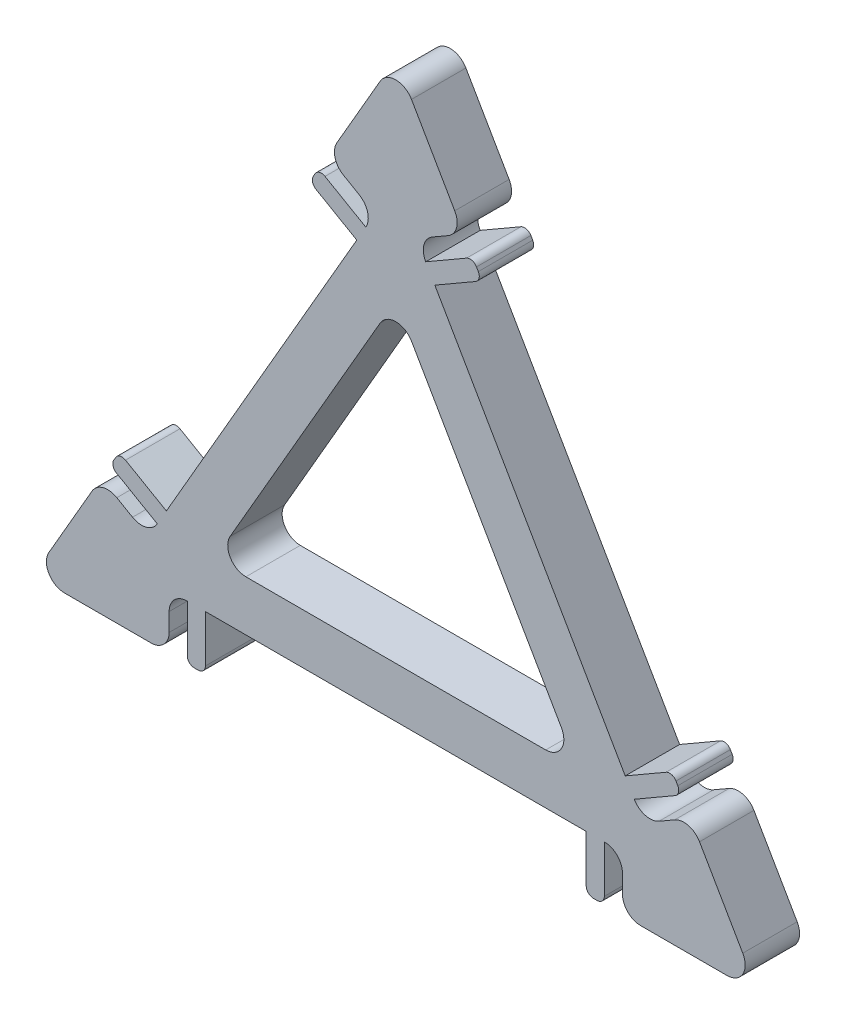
ISO-10303-21;
HEADER;
FILE_DESCRIPTION(('STEP AP214'),'2;1');
FILE_NAME('part.step','',(''),(''),'','','');
FILE_SCHEMA(('AUTOMOTIVE_DESIGN { 1 0 10303 214 1 1 1 1 }'));
ENDSEC;
DATA;
#1=APPLICATION_CONTEXT('core data for automotive mechanical design processes');
#2=APPLICATION_PROTOCOL_DEFINITION('international standard','automotive_design',2000,#1);
#3=PRODUCT_CONTEXT('',#1,'mechanical');
#4=PRODUCT('Part','Part','',(#3));
#5=PRODUCT_RELATED_PRODUCT_CATEGORY('part','',(#4));
#6=PRODUCT_DEFINITION_FORMATION('','',#4);
#7=PRODUCT_DEFINITION_CONTEXT('part definition',#1,'design');
#8=PRODUCT_DEFINITION('design','',#6,#7);
#9=PRODUCT_DEFINITION_SHAPE('','',#8);
#10=(LENGTH_UNIT() NAMED_UNIT(*) SI_UNIT(.MILLI.,.METRE.));
#11=(NAMED_UNIT(*) PLANE_ANGLE_UNIT() SI_UNIT($,.RADIAN.));
#12=(NAMED_UNIT(*) SI_UNIT($,.STERADIAN.) SOLID_ANGLE_UNIT());
#13=UNCERTAINTY_MEASURE_WITH_UNIT(LENGTH_MEASURE(1.E-05),#10,'distance_accuracy_value','');
#14=(GEOMETRIC_REPRESENTATION_CONTEXT(3) GLOBAL_UNCERTAINTY_ASSIGNED_CONTEXT((#13)) GLOBAL_UNIT_ASSIGNED_CONTEXT((#10,
#11,#12)) REPRESENTATION_CONTEXT('',''));
#15=CARTESIAN_POINT('',(0.,0.,0.));
#16=DIRECTION('',(0.,0.,1.));
#17=DIRECTION('',(1.,0.,0.));
#18=AXIS2_PLACEMENT_3D('',#15,#16,#17);
#19=CARTESIAN_POINT('',(1.65192378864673,14.2327948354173,3.));
#20=DIRECTION('',(-0.866025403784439,-0.5,0.));
#21=DIRECTION('',(0.5,-0.866025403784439,0.));
#22=AXIS2_PLACEMENT_3D('',#19,#20,#21);
#23=PLANE('',#22);
#24=DIRECTION('',(0.,0.,1.));
#25=VECTOR('',#24,1.);
#26=CARTESIAN_POINT('',(12.6519237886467,-4.81976404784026,0.));
#27=LINE('',#26,#25);
#28=CARTESIAN_POINT('',(12.6519237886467,-4.81976404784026,0.));
#29=VERTEX_POINT('',#28);
#30=CARTESIAN_POINT('',(12.6519237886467,-4.81976404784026,3.));
#31=VERTEX_POINT('',#30);
#32=EDGE_CURVE('E533',#29,#31,#27,.T.);
#33=ORIENTED_EDGE('',*,*,#32,.F.);
#34=DIRECTION('',(-0.5,0.866025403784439,0.));
#35=VECTOR('',#34,1.);
#36=CARTESIAN_POINT('',(1.65192378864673,14.2327948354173,0.));
#37=LINE('',#36,#35);
#38=CARTESIAN_POINT('',(2.15192378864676,13.3667694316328,0.));
#39=VERTEX_POINT('',#38);
#40=EDGE_CURVE('E854',#29,#39,#37,.T.);
#41=ORIENTED_EDGE('',*,*,#40,.T.);
#42=DIRECTION('',(0.,0.,1.));
#43=VECTOR('',#42,1.);
#44=CARTESIAN_POINT('',(2.15192378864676,13.3667694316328,0.));
#45=LINE('',#44,#43);
#46=CARTESIAN_POINT('',(2.15192378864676,13.3667694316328,3.));
#47=VERTEX_POINT('',#46);
#48=EDGE_CURVE('E601',#39,#47,#45,.T.);
#49=ORIENTED_EDGE('',*,*,#48,.T.);
#50=DIRECTION('',(-0.5,0.866025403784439,0.));
#51=VECTOR('',#50,1.);
#52=CARTESIAN_POINT('',(1.65192378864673,14.2327948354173,3.));
#53=LINE('',#52,#51);
#54=EDGE_CURVE('E790',#31,#47,#53,.T.);
#55=ORIENTED_EDGE('',*,*,#54,.F.);
#56=EDGE_LOOP('',(#33,#41,#49,#55));
#57=FACE_BOUND('',#56,.T.);
#58=ADVANCED_FACE('F35',(#57),#23,.F.);
#59=CARTESIAN_POINT('',(-1.65192378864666,14.2327948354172,3.));
#60=DIRECTION('',(0.866025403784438,-0.500000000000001,0.));
#61=DIRECTION('',(0.500000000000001,0.866025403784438,0.));
#62=AXIS2_PLACEMENT_3D('',#59,#60,#61);
#63=PLANE('',#62);
#64=DIRECTION('',(0.,0.,1.));
#65=VECTOR('',#64,1.);
#66=CARTESIAN_POINT('',(-2.15192378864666,13.3667694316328,0.));
#67=LINE('',#66,#65);
#68=CARTESIAN_POINT('',(-2.15192378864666,13.3667694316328,0.));
#69=VERTEX_POINT('',#68);
#70=CARTESIAN_POINT('',(-2.15192378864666,13.3667694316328,3.));
#71=VERTEX_POINT('',#70);
#72=EDGE_CURVE('E565',#69,#71,#67,.T.);
#73=ORIENTED_EDGE('',*,*,#72,.F.);
#74=DIRECTION('',(-0.500000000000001,-0.866025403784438,0.));
#75=VECTOR('',#74,1.);
#76=CARTESIAN_POINT('',(-1.65192378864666,14.2327948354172,0.));
#77=LINE('',#76,#75);
#78=CARTESIAN_POINT('',(-12.6519237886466,-4.8197640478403,0.));
#79=VERTEX_POINT('',#78);
#80=EDGE_CURVE('E812',#69,#79,#77,.T.);
#81=ORIENTED_EDGE('',*,*,#80,.T.);
#82=DIRECTION('',(0.,0.,1.));
#83=VECTOR('',#82,1.);
#84=CARTESIAN_POINT('',(-12.6519237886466,-4.8197640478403,0.));
#85=LINE('',#84,#83);
#86=CARTESIAN_POINT('',(-12.6519237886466,-4.8197640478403,3.));
#87=VERTEX_POINT('',#86);
#88=EDGE_CURVE('E645',#79,#87,#85,.T.);
#89=ORIENTED_EDGE('',*,*,#88,.T.);
#90=DIRECTION('',(-0.500000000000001,-0.866025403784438,0.));
#91=VECTOR('',#90,1.);
#92=CARTESIAN_POINT('',(-1.65192378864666,14.2327948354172,3.));
#93=LINE('',#92,#91);
#94=EDGE_CURVE('E747',#71,#87,#93,.T.);
#95=ORIENTED_EDGE('',*,*,#94,.F.);
#96=EDGE_LOOP('',(#73,#81,#89,#95));
#97=FACE_BOUND('',#96,.T.);
#98=ADVANCED_FACE('F1183',(#97),#63,.F.);
#99=CARTESIAN_POINT('',(11.5,-8.54700538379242,3.));
#100=DIRECTION('',(0.,1.,0.));
#101=DIRECTION('',(-1.,0.,0.));
#102=AXIS2_PLACEMENT_3D('',#99,#100,#101);
#103=PLANE('',#102);
#104=DIRECTION('',(1.,0.,0.));
#105=VECTOR('',#104,1.);
#106=CARTESIAN_POINT('',(11.5,-8.54700538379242,0.));
#107=LINE('',#106,#105);
#108=CARTESIAN_POINT('',(-10.4999999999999,-8.54700538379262,0.));
#109=VERTEX_POINT('',#108);
#110=CARTESIAN_POINT('',(10.5,-8.54700538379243,0.));
#111=VERTEX_POINT('',#110);
#112=EDGE_CURVE('E833',#109,#111,#107,.T.);
#113=ORIENTED_EDGE('',*,*,#112,.T.);
#114=DIRECTION('',(0.,0.,1.));
#115=VECTOR('',#114,1.);
#116=CARTESIAN_POINT('',(10.5,-8.54700538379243,0.));
#117=LINE('',#116,#115);
#118=CARTESIAN_POINT('',(10.5,-8.54700538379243,3.));
#119=VERTEX_POINT('',#118);
#120=EDGE_CURVE('E474',#111,#119,#117,.T.);
#121=ORIENTED_EDGE('',*,*,#120,.T.);
#122=DIRECTION('',(1.,0.,0.));
#123=VECTOR('',#122,1.);
#124=CARTESIAN_POINT('',(11.5,-8.54700538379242,3.));
#125=LINE('',#124,#123);
#126=CARTESIAN_POINT('',(-10.4999999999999,-8.54700538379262,3.));
#127=VERTEX_POINT('',#126);
#128=EDGE_CURVE('E768',#127,#119,#125,.T.);
#129=ORIENTED_EDGE('',*,*,#128,.F.);
#130=DIRECTION('',(0.,0.,1.));
#131=VECTOR('',#130,1.);
#132=CARTESIAN_POINT('',(-10.4999999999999,-8.54700538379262,0.));
#133=LINE('',#132,#131);
#134=EDGE_CURVE('E684',#109,#127,#133,.T.);
#135=ORIENTED_EDGE('',*,*,#134,.F.);
#136=EDGE_LOOP('',(#113,#121,#129,#135));
#137=FACE_BOUND('',#136,.T.);
#138=ADVANCED_FACE('F1090',(#137),#103,.F.);
#139=CARTESIAN_POINT('',(0.,21.094010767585,3.));
#140=DIRECTION('',(0.,0.,1.));
#141=DIRECTION('',(1.,0.,0.));
#142=AXIS2_PLACEMENT_3D('',#139,#140,#141);
#143=PLANE('',#142);
#144=CARTESIAN_POINT('',(0.,21.094010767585,3.));
#145=DIRECTION('',(0.,0.,1.));
#146=DIRECTION('',(1.,0.,0.));
#147=AXIS2_PLACEMENT_3D('',#144,#145,#146);
#148=CIRCLE('',#147,1.);
#149=CARTESIAN_POINT('',(0.866025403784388,21.5940107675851,3.));
#150=VERTEX_POINT('',#149);
#151=CARTESIAN_POINT('',(-0.866025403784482,21.594010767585,3.));
#152=VERTEX_POINT('',#151);
#153=EDGE_CURVE('E734',#150,#152,#148,.T.);
#154=ORIENTED_EDGE('',*,*,#153,.T.);
#155=DIRECTION('',(-0.499999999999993,-0.866025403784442,0.));
#156=VECTOR('',#155,1.);
#157=CARTESIAN_POINT('',(-0.866025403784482,21.594010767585,3.));
#158=LINE('',#157,#156);
#159=CARTESIAN_POINT('',(-3.25000000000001,17.4648456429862,3.));
#160=VERTEX_POINT('',#159);
#161=EDGE_CURVE('E737',#152,#160,#158,.T.);
#162=ORIENTED_EDGE('',*,*,#161,.T.);
#163=CARTESIAN_POINT('',(-2.38397459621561,16.9648456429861,3.));
#164=DIRECTION('',(0.,0.,1.));
#165=DIRECTION('',(-1.,0.,0.));
#166=AXIS2_PLACEMENT_3D('',#163,#164,#165);
#167=CIRCLE('',#166,0.999999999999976);
#168=CARTESIAN_POINT('',(-2.8839745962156,16.0988202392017,3.));
#169=VERTEX_POINT('',#168);
#170=EDGE_CURVE('E740',#160,#169,#167,.T.);
#171=ORIENTED_EDGE('',*,*,#170,.T.);
#172=DIRECTION('',(0.866025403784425,-0.500000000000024,0.));
#173=VECTOR('',#172,1.);
#174=CARTESIAN_POINT('',(-2.8839745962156,16.0988202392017,3.));
#175=LINE('',#174,#173);
#176=CARTESIAN_POINT('',(-2.01794919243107,15.5988202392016,3.));
#177=VERTEX_POINT('',#176);
#178=EDGE_CURVE('E742',#169,#177,#175,.T.);
#179=ORIENTED_EDGE('',*,*,#178,.T.);
#180=CARTESIAN_POINT('',(-2.51794919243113,14.7327948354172,3.));
#181=DIRECTION('',(0.,0.,-1.));
#182=DIRECTION('',(1.,0.,0.));
#183=AXIS2_PLACEMENT_3D('',#180,#181,#182);
#184=CIRCLE('',#183,1.00000000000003);
#185=CARTESIAN_POINT('',(-1.65192378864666,14.2327948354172,3.));
#186=VERTEX_POINT('',#185);
#187=EDGE_CURVE('E744',#177,#186,#184,.T.);
#188=ORIENTED_EDGE('',*,*,#187,.T.);
#189=DIRECTION('',(-0.866025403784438,0.5,0.));
#190=VECTOR('',#189,1.);
#191=CARTESIAN_POINT('',(5.74999999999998,9.95929214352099,3.));
#192=LINE('',#191,#190);
#193=CARTESIAN_POINT('',(-3.9035898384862,15.5327948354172,3.));
#194=VERTEX_POINT('',#193);
#195=EDGE_CURVE('E540',#186,#194,#192,.T.);
#196=ORIENTED_EDGE('',*,*,#195,.T.);
#197=CARTESIAN_POINT('',(-4.1035898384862,15.1863846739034,3.));
#198=DIRECTION('',(0.,0.,1.));
#199=DIRECTION('',(1.,0.,0.));
#200=AXIS2_PLACEMENT_3D('',#197,#198,#199);
#201=CIRCLE('',#200,0.4);
#202=CARTESIAN_POINT('',(-4.44999999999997,15.3863846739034,3.));
#203=VERTEX_POINT('',#202);
#204=EDGE_CURVE('E528',#203,#194,#201,.F.);
#205=ORIENTED_EDGE('',*,*,#204,.F.);
#206=DIRECTION('',(-0.500000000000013,-0.866025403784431,0.));
#207=VECTOR('',#206,1.);
#208=CARTESIAN_POINT('',(-10.,5.77350269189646,3.));
#209=LINE('',#208,#207);
#210=CARTESIAN_POINT('',(-4.54999999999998,15.2131795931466,3.));
#211=VERTEX_POINT('',#210);
#212=EDGE_CURVE('E553',#203,#211,#209,.T.);
#213=ORIENTED_EDGE('',*,*,#212,.T.);
#214=CARTESIAN_POINT('',(-4.2035898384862,15.0131795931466,3.));
#215=DIRECTION('',(0.,0.,1.));
#216=DIRECTION('',(1.,0.,0.));
#217=AXIS2_PLACEMENT_3D('',#214,#215,#216);
#218=CIRCLE('',#217,0.400000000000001);
#219=CARTESIAN_POINT('',(-4.4035898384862,14.6667694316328,3.));
#220=VERTEX_POINT('',#219);
#221=EDGE_CURVE('E556',#220,#211,#218,.F.);
#222=ORIENTED_EDGE('',*,*,#221,.F.);
#223=DIRECTION('',(-0.866025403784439,0.5,0.));
#224=VECTOR('',#223,1.);
#225=CARTESIAN_POINT('',(5.24999999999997,9.09326673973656,3.));
#226=LINE('',#225,#224);
#227=EDGE_CURVE('E57',#71,#220,#226,.T.);
#228=ORIENTED_EDGE('',*,*,#227,.F.);
#229=ORIENTED_EDGE('',*,*,#94,.T.);
#230=DIRECTION('',(-0.866025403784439,0.499999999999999,0.));
#231=VECTOR('',#230,1.);
#232=CARTESIAN_POINT('',(-5.24999999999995,-9.09326673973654,3.));
#233=LINE('',#232,#231);
#234=CARTESIAN_POINT('',(-14.9035898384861,-3.51976404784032,3.));
#235=VERTEX_POINT('',#234);
#236=EDGE_CURVE('E635',#87,#235,#233,.T.);
#237=ORIENTED_EDGE('',*,*,#236,.T.);
#238=CARTESIAN_POINT('',(-15.1035898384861,-3.8661742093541,3.));
#239=DIRECTION('',(0.,0.,1.));
#240=DIRECTION('',(1.,0.,0.));
#241=AXIS2_PLACEMENT_3D('',#238,#239,#240);
#242=CIRCLE('',#241,0.399999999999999);
#243=CARTESIAN_POINT('',(-15.4499999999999,-3.6661742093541,3.));
#244=VERTEX_POINT('',#243);
#245=EDGE_CURVE('E615',#235,#244,#242,.T.);
#246=ORIENTED_EDGE('',*,*,#245,.T.);
#247=DIRECTION('',(0.500000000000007,0.866025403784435,0.));
#248=VECTOR('',#247,1.);
#249=CARTESIAN_POINT('',(-9.99999999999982,5.77350269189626,3.));
#250=LINE('',#249,#248);
#251=CARTESIAN_POINT('',(-15.5499999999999,-3.83937929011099,3.));
#252=VERTEX_POINT('',#251);
#253=EDGE_CURVE('E604',#252,#244,#250,.T.);
#254=ORIENTED_EDGE('',*,*,#253,.F.);
#255=CARTESIAN_POINT('',(-15.2035898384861,-4.03937929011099,3.));
#256=DIRECTION('',(0.,0.,1.));
#257=DIRECTION('',(1.,0.,0.));
#258=AXIS2_PLACEMENT_3D('',#255,#256,#257);
#259=CIRCLE('',#258,0.399999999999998);
#260=CARTESIAN_POINT('',(-15.4035898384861,-4.38578945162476,3.));
#261=VERTEX_POINT('',#260);
#262=EDGE_CURVE('E629',#252,#261,#259,.T.);
#263=ORIENTED_EDGE('',*,*,#262,.T.);
#264=DIRECTION('',(-0.866025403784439,0.499999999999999,0.));
#265=VECTOR('',#264,1.);
#266=CARTESIAN_POINT('',(-5.74999999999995,-9.95929214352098,3.));
#267=LINE('',#266,#265);
#268=CARTESIAN_POINT('',(-13.1519237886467,-5.68578945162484,3.));
#269=VERTEX_POINT('',#268);
#270=EDGE_CURVE('E632',#269,#261,#267,.T.);
#271=ORIENTED_EDGE('',*,*,#270,.F.);
#272=CARTESIAN_POINT('',(-14.0179491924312,-5.18578945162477,3.));
#273=DIRECTION('',(0.,0.,-1.));
#274=DIRECTION('',(1.,0.,0.));
#275=AXIS2_PLACEMENT_3D('',#272,#273,#274);
#276=CIRCLE('',#275,1.00000000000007);
#277=CARTESIAN_POINT('',(-14.5179491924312,-6.05181485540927,3.));
#278=VERTEX_POINT('',#277);
#279=EDGE_CURVE('E749',#269,#278,#276,.T.);
#280=ORIENTED_EDGE('',*,*,#279,.T.);
#281=DIRECTION('',(-0.866025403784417,0.500000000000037,0.));
#282=VECTOR('',#281,1.);
#283=CARTESIAN_POINT('',(-15.3839745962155,-5.55181485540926,3.));
#284=LINE('',#283,#282);
#285=CARTESIAN_POINT('',(-15.3839745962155,-5.55181485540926,3.));
#286=VERTEX_POINT('',#285);
#287=EDGE_CURVE('E751',#278,#286,#284,.T.);
#288=ORIENTED_EDGE('',*,*,#287,.T.);
#289=CARTESIAN_POINT('',(-15.8839745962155,-6.41784025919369,3.));
#290=DIRECTION('',(0.,0.,1.));
#291=DIRECTION('',(-1.,0.,0.));
#292=AXIS2_PLACEMENT_3D('',#289,#290,#291);
#293=CIRCLE('',#292,1.);
#294=CARTESIAN_POINT('',(-16.75,-5.9178402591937,3.));
#295=VERTEX_POINT('',#294);
#296=EDGE_CURVE('E753',#286,#295,#293,.T.);
#297=ORIENTED_EDGE('',*,*,#296,.T.);
#298=DIRECTION('',(-0.499999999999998,-0.86602540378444,0.));
#299=VECTOR('',#298,1.);
#300=CARTESIAN_POINT('',(-16.75,-5.9178402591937,3.));
#301=LINE('',#300,#299);
#302=CARTESIAN_POINT('',(-19.1339745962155,-10.0470053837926,3.));
#303=VERTEX_POINT('',#302);
#304=EDGE_CURVE('E755',#295,#303,#301,.T.);
#305=ORIENTED_EDGE('',*,*,#304,.T.);
#306=CARTESIAN_POINT('',(-18.2679491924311,-10.5470053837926,3.));
#307=DIRECTION('',(0.,0.,1.));
#308=DIRECTION('',(-1.,0.,0.));
#309=AXIS2_PLACEMENT_3D('',#306,#307,#308);
#310=CIRCLE('',#309,1.);
#311=CARTESIAN_POINT('',(-18.2679491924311,-11.5470053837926,3.));
#312=VERTEX_POINT('',#311);
#313=EDGE_CURVE('E757',#303,#312,#310,.T.);
#314=ORIENTED_EDGE('',*,*,#313,.T.);
#315=DIRECTION('',(1.,0.,0.));
#316=VECTOR('',#315,1.);
#317=CARTESIAN_POINT('',(-18.2679491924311,-11.5470053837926,3.));
#318=LINE('',#317,#316);
#319=CARTESIAN_POINT('',(-13.5,-11.5470053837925,3.));
#320=VERTEX_POINT('',#319);
#321=EDGE_CURVE('E759',#312,#320,#318,.T.);
#322=ORIENTED_EDGE('',*,*,#321,.T.);
#323=CARTESIAN_POINT('',(-13.5,-10.5470053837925,3.));
#324=DIRECTION('',(0.,0.,1.));
#325=DIRECTION('',(1.,0.,0.));
#326=AXIS2_PLACEMENT_3D('',#323,#324,#325);
#327=CIRCLE('',#326,1.);
#328=CARTESIAN_POINT('',(-12.5,-10.5470053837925,3.));
#329=VERTEX_POINT('',#328);
#330=EDGE_CURVE('E761',#320,#329,#327,.T.);
#331=ORIENTED_EDGE('',*,*,#330,.T.);
#332=DIRECTION('',(0.,1.,0.));
#333=VECTOR('',#332,1.);
#334=CARTESIAN_POINT('',(-12.5,-10.5470053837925,3.));
#335=LINE('',#334,#333);
#336=CARTESIAN_POINT('',(-12.5,-9.54700538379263,3.));
#337=VERTEX_POINT('',#336);
#338=EDGE_CURVE('E763',#329,#337,#335,.T.);
#339=ORIENTED_EDGE('',*,*,#338,.T.);
#340=CARTESIAN_POINT('',(-11.5,-9.54700538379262,3.));
#341=DIRECTION('',(0.,0.,-1.));
#342=DIRECTION('',(-1.,0.,0.));
#343=AXIS2_PLACEMENT_3D('',#340,#341,#342);
#344=CIRCLE('',#343,0.999999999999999);
#345=CARTESIAN_POINT('',(-11.5,-8.54700538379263,3.));
#346=VERTEX_POINT('',#345);
#347=EDGE_CURVE('E765',#337,#346,#344,.T.);
#348=ORIENTED_EDGE('',*,*,#347,.T.);
#349=DIRECTION('',(0.,-1.,0.));
#350=VECTOR('',#349,1.);
#351=CARTESIAN_POINT('',(-11.4999999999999,0.,3.));
#352=LINE('',#351,#350);
#353=CARTESIAN_POINT('',(-11.4999999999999,-11.1470053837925,3.));
#354=VERTEX_POINT('',#353);
#355=EDGE_CURVE('E669',#346,#354,#352,.T.);
#356=ORIENTED_EDGE('',*,*,#355,.T.);
#357=CARTESIAN_POINT('',(-11.0999999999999,-11.1470053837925,3.));
#358=DIRECTION('',(0.,0.,1.));
#359=DIRECTION('',(1.,0.,0.));
#360=AXIS2_PLACEMENT_3D('',#357,#358,#359);
#361=CIRCLE('',#360,0.399999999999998);
#362=CARTESIAN_POINT('',(-11.0999999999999,-11.5470053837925,3.));
#363=VERTEX_POINT('',#362);
#364=EDGE_CURVE('E672',#363,#354,#361,.F.);
#365=ORIENTED_EDGE('',*,*,#364,.F.);
#366=DIRECTION('',(1.,0.,0.));
#367=VECTOR('',#366,1.);
#368=CARTESIAN_POINT('',(1.00154306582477E-13,-11.5470053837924,3.));
#369=LINE('',#368,#367);
#370=CARTESIAN_POINT('',(-10.8999999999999,-11.5470053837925,3.));
#371=VERTEX_POINT('',#370);
#372=EDGE_CURVE('E654',#363,#371,#369,.T.);
#373=ORIENTED_EDGE('',*,*,#372,.T.);
#374=CARTESIAN_POINT('',(-10.8999999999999,-11.1470053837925,3.));
#375=DIRECTION('',(0.,0.,1.));
#376=DIRECTION('',(1.,0.,0.));
#377=AXIS2_PLACEMENT_3D('',#374,#375,#376);
#378=CIRCLE('',#377,0.399999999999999);
#379=CARTESIAN_POINT('',(-10.4999999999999,-11.1470053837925,3.));
#380=VERTEX_POINT('',#379);
#381=EDGE_CURVE('E642',#380,#371,#378,.F.);
#382=ORIENTED_EDGE('',*,*,#381,.F.);
#383=DIRECTION('',(0.,-1.,0.));
#384=VECTOR('',#383,1.);
#385=CARTESIAN_POINT('',(-10.4999999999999,0.,3.));
#386=LINE('',#385,#384);
#387=EDGE_CURVE('E667',#127,#380,#386,.T.);
#388=ORIENTED_EDGE('',*,*,#387,.F.);
#389=ORIENTED_EDGE('',*,*,#128,.T.);
#390=DIRECTION('',(0.,-1.,0.));
#391=VECTOR('',#390,1.);
#392=CARTESIAN_POINT('',(10.4999999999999,0.,3.));
#393=LINE('',#392,#391);
#394=CARTESIAN_POINT('',(10.5,-11.1470053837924,3.));
#395=VERTEX_POINT('',#394);
#396=EDGE_CURVE('E486',#119,#395,#393,.T.);
#397=ORIENTED_EDGE('',*,*,#396,.T.);
#398=CARTESIAN_POINT('',(10.9,-11.1470053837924,3.));
#399=DIRECTION('',(0.,0.,1.));
#400=DIRECTION('',(1.,0.,0.));
#401=AXIS2_PLACEMENT_3D('',#398,#399,#400);
#402=CIRCLE('',#401,0.400000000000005);
#403=CARTESIAN_POINT('',(10.9,-11.5470053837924,3.));
#404=VERTEX_POINT('',#403);
#405=EDGE_CURVE('E452',#395,#404,#402,.T.);
#406=ORIENTED_EDGE('',*,*,#405,.T.);
#407=DIRECTION('',(-1.,0.,0.));
#408=VECTOR('',#407,1.);
#409=CARTESIAN_POINT('',(5.00771532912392E-13,-11.5470053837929,3.));
#410=LINE('',#409,#408);
#411=CARTESIAN_POINT('',(11.1,-11.5470053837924,3.));
#412=VERTEX_POINT('',#411);
#413=EDGE_CURVE('E489',#412,#404,#410,.T.);
#414=ORIENTED_EDGE('',*,*,#413,.F.);
#415=CARTESIAN_POINT('',(11.1,-11.1470053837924,3.));
#416=DIRECTION('',(0.,0.,1.));
#417=DIRECTION('',(1.,0.,0.));
#418=AXIS2_PLACEMENT_3D('',#415,#416,#417);
#419=CIRCLE('',#418,0.4);
#420=CARTESIAN_POINT('',(11.5,-11.1470053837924,3.));
#421=VERTEX_POINT('',#420);
#422=EDGE_CURVE('E478',#412,#421,#419,.T.);
#423=ORIENTED_EDGE('',*,*,#422,.T.);
#424=DIRECTION('',(0.,-1.,0.));
#425=VECTOR('',#424,1.);
#426=CARTESIAN_POINT('',(11.4999999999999,0.,3.));
#427=LINE('',#426,#425);
#428=CARTESIAN_POINT('',(11.5,-8.54700538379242,3.));
#429=VERTEX_POINT('',#428);
#430=EDGE_CURVE('E475',#429,#421,#427,.T.);
#431=ORIENTED_EDGE('',*,*,#430,.F.);
#432=CARTESIAN_POINT('',(11.5,-9.54700538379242,3.));
#433=DIRECTION('',(0.,0.,-1.));
#434=DIRECTION('',(1.,0.,0.));
#435=AXIS2_PLACEMENT_3D('',#432,#433,#434);
#436=CIRCLE('',#435,1.);
#437=CARTESIAN_POINT('',(12.5,-9.54700538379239,3.));
#438=VERTEX_POINT('',#437);
#439=EDGE_CURVE('E771',#429,#438,#436,.T.);
#440=ORIENTED_EDGE('',*,*,#439,.T.);
#441=DIRECTION('',(0.,-1.,0.));
#442=VECTOR('',#441,1.);
#443=CARTESIAN_POINT('',(12.5,-10.5470053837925,3.));
#444=LINE('',#443,#442);
#445=CARTESIAN_POINT('',(12.5,-10.5470053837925,3.));
#446=VERTEX_POINT('',#445);
#447=EDGE_CURVE('E773',#438,#446,#444,.T.);
#448=ORIENTED_EDGE('',*,*,#447,.T.);
#449=CARTESIAN_POINT('',(13.5,-10.5470053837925,3.));
#450=DIRECTION('',(0.,0.,1.));
#451=DIRECTION('',(-1.,0.,0.));
#452=AXIS2_PLACEMENT_3D('',#449,#450,#451);
#453=CIRCLE('',#452,1.);
#454=CARTESIAN_POINT('',(13.5,-11.5470053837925,3.));
#455=VERTEX_POINT('',#454);
#456=EDGE_CURVE('E775',#446,#455,#453,.T.);
#457=ORIENTED_EDGE('',*,*,#456,.T.);
#458=DIRECTION('',(1.,0.,0.));
#459=VECTOR('',#458,1.);
#460=CARTESIAN_POINT('',(13.5,-11.5470053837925,3.));
#461=LINE('',#460,#459);
#462=CARTESIAN_POINT('',(18.2679491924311,-11.5470053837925,3.));
#463=VERTEX_POINT('',#462);
#464=EDGE_CURVE('E777',#455,#463,#461,.T.);
#465=ORIENTED_EDGE('',*,*,#464,.T.);
#466=CARTESIAN_POINT('',(18.2679491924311,-10.5470053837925,3.));
#467=DIRECTION('',(0.,0.,1.));
#468=DIRECTION('',(-1.,0.,0.));
#469=AXIS2_PLACEMENT_3D('',#466,#467,#468);
#470=CIRCLE('',#469,0.999999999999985);
#471=CARTESIAN_POINT('',(19.1339745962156,-10.0470053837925,3.));
#472=VERTEX_POINT('',#471);
#473=EDGE_CURVE('E779',#463,#472,#470,.T.);
#474=ORIENTED_EDGE('',*,*,#473,.T.);
#475=DIRECTION('',(-0.499999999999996,0.866025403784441,0.));
#476=VECTOR('',#475,1.);
#477=CARTESIAN_POINT('',(19.1339745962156,-10.0470053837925,3.));
#478=LINE('',#477,#476);
#479=CARTESIAN_POINT('',(16.75,-5.91784025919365,3.));
#480=VERTEX_POINT('',#479);
#481=EDGE_CURVE('E781',#472,#480,#478,.T.);
#482=ORIENTED_EDGE('',*,*,#481,.T.);
#483=CARTESIAN_POINT('',(15.8839745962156,-6.41784025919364,3.));
#484=DIRECTION('',(0.,0.,1.));
#485=DIRECTION('',(-1.,0.,0.));
#486=AXIS2_PLACEMENT_3D('',#483,#484,#485);
#487=CIRCLE('',#486,1.);
#488=CARTESIAN_POINT('',(15.3839745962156,-5.5518148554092,3.));
#489=VERTEX_POINT('',#488);
#490=EDGE_CURVE('E783',#480,#489,#487,.T.);
#491=ORIENTED_EDGE('',*,*,#490,.T.);
#492=DIRECTION('',(-0.866025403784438,-0.5,0.));
#493=VECTOR('',#492,1.);
#494=CARTESIAN_POINT('',(15.3839745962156,-5.5518148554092,3.));
#495=LINE('',#494,#493);
#496=CARTESIAN_POINT('',(14.5179491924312,-6.0518148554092,3.));
#497=VERTEX_POINT('',#496);
#498=EDGE_CURVE('E785',#489,#497,#495,.T.);
#499=ORIENTED_EDGE('',*,*,#498,.T.);
#500=CARTESIAN_POINT('',(14.0179491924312,-5.18578945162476,3.));
#501=DIRECTION('',(0.,0.,-1.));
#502=DIRECTION('',(1.,0.,0.));
#503=AXIS2_PLACEMENT_3D('',#500,#501,#502);
#504=CIRCLE('',#503,1.);
#505=CARTESIAN_POINT('',(13.1519237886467,-5.68578945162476,3.));
#506=VERTEX_POINT('',#505);
#507=EDGE_CURVE('E787',#497,#506,#504,.T.);
#508=ORIENTED_EDGE('',*,*,#507,.T.);
#509=DIRECTION('',(0.866025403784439,0.499999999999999,0.));
#510=VECTOR('',#509,1.);
#511=CARTESIAN_POINT('',(5.74999999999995,-9.95929214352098,3.));
#512=LINE('',#511,#510);
#513=CARTESIAN_POINT('',(15.4035898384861,-4.38578945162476,3.));
#514=VERTEX_POINT('',#513);
#515=EDGE_CURVE('E518',#506,#514,#512,.T.);
#516=ORIENTED_EDGE('',*,*,#515,.T.);
#517=CARTESIAN_POINT('',(15.2035898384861,-4.03937929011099,3.));
#518=DIRECTION('',(0.,0.,1.));
#519=DIRECTION('',(1.,0.,0.));
#520=AXIS2_PLACEMENT_3D('',#517,#518,#519);
#521=CIRCLE('',#520,0.399999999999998);
#522=CARTESIAN_POINT('',(15.5499999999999,-3.83937929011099,3.));
#523=VERTEX_POINT('',#522);
#524=EDGE_CURVE('E521',#523,#514,#521,.F.);
#525=ORIENTED_EDGE('',*,*,#524,.F.);
#526=DIRECTION('',(-0.500000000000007,0.866025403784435,0.));
#527=VECTOR('',#526,1.);
#528=CARTESIAN_POINT('',(9.99999999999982,5.77350269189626,3.));
#529=LINE('',#528,#527);
#530=CARTESIAN_POINT('',(15.4499999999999,-3.6661742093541,3.));
#531=VERTEX_POINT('',#530);
#532=EDGE_CURVE('E504',#523,#531,#529,.T.);
#533=ORIENTED_EDGE('',*,*,#532,.T.);
#534=CARTESIAN_POINT('',(15.1035898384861,-3.8661742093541,3.));
#535=DIRECTION('',(0.,0.,1.));
#536=DIRECTION('',(1.,0.,0.));
#537=AXIS2_PLACEMENT_3D('',#534,#535,#536);
#538=CIRCLE('',#537,0.399999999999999);
#539=CARTESIAN_POINT('',(14.9035898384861,-3.51976404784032,3.));
#540=VERTEX_POINT('',#539);
#541=EDGE_CURVE('E495',#540,#531,#538,.F.);
#542=ORIENTED_EDGE('',*,*,#541,.F.);
#543=DIRECTION('',(0.866025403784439,0.499999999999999,0.));
#544=VECTOR('',#543,1.);
#545=CARTESIAN_POINT('',(5.24999999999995,-9.09326673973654,3.));
#546=LINE('',#545,#544);
#547=EDGE_CURVE('E50',#31,#540,#546,.T.);
#548=ORIENTED_EDGE('',*,*,#547,.F.);
#549=ORIENTED_EDGE('',*,*,#54,.T.);
#550=DIRECTION('',(0.866025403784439,0.5,0.));
#551=VECTOR('',#550,1.);
#552=CARTESIAN_POINT('',(-5.24999999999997,9.09326673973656,3.));
#553=LINE('',#552,#551);
#554=CARTESIAN_POINT('',(4.4035898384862,14.6667694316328,3.));
#555=VERTEX_POINT('',#554);
#556=EDGE_CURVE('E564',#47,#555,#553,.T.);
#557=ORIENTED_EDGE('',*,*,#556,.T.);
#558=CARTESIAN_POINT('',(4.2035898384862,15.0131795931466,3.));
#559=DIRECTION('',(0.,0.,1.));
#560=DIRECTION('',(1.,0.,0.));
#561=AXIS2_PLACEMENT_3D('',#558,#559,#560);
#562=CIRCLE('',#561,0.400000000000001);
#563=CARTESIAN_POINT('',(4.54999999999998,15.2131795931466,3.));
#564=VERTEX_POINT('',#563);
#565=EDGE_CURVE('E590',#555,#564,#562,.T.);
#566=ORIENTED_EDGE('',*,*,#565,.T.);
#567=DIRECTION('',(0.500000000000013,-0.866025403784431,0.));
#568=VECTOR('',#567,1.);
#569=CARTESIAN_POINT('',(10.,5.77350269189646,3.));
#570=LINE('',#569,#568);
#571=CARTESIAN_POINT('',(4.44999999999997,15.3863846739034,3.));
#572=VERTEX_POINT('',#571);
#573=EDGE_CURVE('E593',#572,#564,#570,.T.);
#574=ORIENTED_EDGE('',*,*,#573,.F.);
#575=CARTESIAN_POINT('',(4.1035898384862,15.1863846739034,3.));
#576=DIRECTION('',(0.,0.,1.));
#577=DIRECTION('',(1.,0.,0.));
#578=AXIS2_PLACEMENT_3D('',#575,#576,#577);
#579=CIRCLE('',#578,0.4);
#580=CARTESIAN_POINT('',(3.9035898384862,15.5327948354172,3.));
#581=VERTEX_POINT('',#580);
#582=EDGE_CURVE('E596',#572,#581,#579,.T.);
#583=ORIENTED_EDGE('',*,*,#582,.T.);
#584=DIRECTION('',(0.866025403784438,0.5,0.));
#585=VECTOR('',#584,1.);
#586=CARTESIAN_POINT('',(-5.74999999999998,9.95929214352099,3.));
#587=LINE('',#586,#585);
#588=CARTESIAN_POINT('',(1.65192378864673,14.2327948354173,3.));
#589=VERTEX_POINT('',#588);
#590=EDGE_CURVE('E577',#589,#581,#587,.T.);
#591=ORIENTED_EDGE('',*,*,#590,.F.);
#592=CARTESIAN_POINT('',(2.51794919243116,14.7327948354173,3.));
#593=DIRECTION('',(0.,0.,-1.));
#594=DIRECTION('',(-1.,0.,0.));
#595=AXIS2_PLACEMENT_3D('',#592,#593,#594);
#596=CIRCLE('',#595,1.);
#597=CARTESIAN_POINT('',(2.01794919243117,15.5988202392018,3.));
#598=VERTEX_POINT('',#597);
#599=EDGE_CURVE('E792',#589,#598,#596,.T.);
#600=ORIENTED_EDGE('',*,*,#599,.T.);
#601=DIRECTION('',(0.866025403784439,0.499999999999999,0.));
#602=VECTOR('',#601,1.);
#603=CARTESIAN_POINT('',(2.88397459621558,16.0988202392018,3.));
#604=LINE('',#603,#602);
#605=CARTESIAN_POINT('',(2.88397459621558,16.0988202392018,3.));
#606=VERTEX_POINT('',#605);
#607=EDGE_CURVE('E794',#598,#606,#604,.T.);
#608=ORIENTED_EDGE('',*,*,#607,.T.);
#609=CARTESIAN_POINT('',(2.38397459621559,16.9648456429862,3.));
#610=DIRECTION('',(0.,0.,1.));
#611=DIRECTION('',(-1.,0.,0.));
#612=AXIS2_PLACEMENT_3D('',#609,#610,#611);
#613=CIRCLE('',#612,1.);
#614=CARTESIAN_POINT('',(3.25000000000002,17.4648456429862,3.));
#615=VERTEX_POINT('',#614);
#616=EDGE_CURVE('E796',#606,#615,#613,.T.);
#617=ORIENTED_EDGE('',*,*,#616,.T.);
#618=DIRECTION('',(-0.500000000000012,0.866025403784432,0.));
#619=VECTOR('',#618,1.);
#620=CARTESIAN_POINT('',(3.25000000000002,17.4648456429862,3.));
#621=LINE('',#620,#619);
#622=EDGE_CURVE('E798',#615,#150,#621,.T.);
#623=ORIENTED_EDGE('',*,*,#622,.T.);
#624=EDGE_LOOP('',(#154,#162,#171,#179,#188,#196,#205,#213,#222,#228,#229,#237,#246,#254,#263,
#271,#280,#288,#297,#305,#314,#322,#331,#339,#348,#356,#365,#373,#382,#388,#389,#397,#406,#414,
#423,#431,#440,#448,#457,#465,#474,#482,#491,#499,#508,#516,#525,#533,#542,#548,#549,#557,#566,
#574,#583,#591,#600,#608,#617,#623));
#625=FACE_BOUND('',#624,.T.);
#626=DIRECTION('',(-0.499850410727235,0.86611175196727,0.));
#627=VECTOR('',#626,1.);
#628=CARTESIAN_POINT('',(9.1322394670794,-4.27450449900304,3.));
#629=LINE('',#628,#627);
#630=CARTESIAN_POINT('',(9.1322394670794,-4.27450449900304,3.));
#631=VERTEX_POINT('',#630);
#632=CARTESIAN_POINT('',(0.867760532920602,10.0457044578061,3.));
#633=VERTEX_POINT('',#632);
#634=EDGE_CURVE('E691',#631,#633,#629,.T.);
#635=ORIENTED_EDGE('',*,*,#634,.F.);
#636=CARTESIAN_POINT('',(8.26612771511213,-4.77435490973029,3.));
#637=DIRECTION('',(0.,0.,1.));
#638=DIRECTION('',(1.,0.,0.));
#639=AXIS2_PLACEMENT_3D('',#636,#637,#638);
#640=CIRCLE('',#639,1.);
#641=CARTESIAN_POINT('',(8.26595499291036,-5.77435489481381,3.));
#642=VERTEX_POINT('',#641);
#643=EDGE_CURVE('E689',#642,#631,#640,.T.);
#644=ORIENTED_EDGE('',*,*,#643,.F.);
#645=DIRECTION('',(0.99999998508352,-0.000172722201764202,0.));
#646=VECTOR('',#645,1.);
#647=CARTESIAN_POINT('',(-8.26794921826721,-5.7714991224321,3.));
#648=LINE('',#647,#646);
#649=CARTESIAN_POINT('',(-8.26794921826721,-5.7714991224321,3.));
#650=VERTEX_POINT('',#649);
#651=EDGE_CURVE('E701',#650,#642,#648,.T.);
#652=ORIENTED_EDGE('',*,*,#651,.F.);
#653=CARTESIAN_POINT('',(-8.26777649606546,-4.77149913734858,3.));
#654=DIRECTION('',(0.,0.,1.));
#655=DIRECTION('',(-1.,0.,0.));
#656=AXIS2_PLACEMENT_3D('',#653,#654,#655);
#657=CIRCLE('',#656,1.);
#658=CARTESIAN_POINT('',(-9.13371552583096,-4.27134956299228,3.));
#659=VERTEX_POINT('',#658);
#660=EDGE_CURVE('E698',#659,#650,#657,.T.);
#661=ORIENTED_EDGE('',*,*,#660,.F.);
#662=DIRECTION('',(-0.500149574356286,-0.865939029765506,0.));
#663=VECTOR('',#662,1.);
#664=CARTESIAN_POINT('',(-0.864290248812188,10.0460036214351,3.));
#665=LINE('',#664,#663);
#666=CARTESIAN_POINT('',(-0.864290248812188,10.0460036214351,3.));
#667=VERTEX_POINT('',#666);
#668=EDGE_CURVE('E696',#667,#659,#665,.T.);
#669=ORIENTED_EDGE('',*,*,#668,.F.);
#670=CARTESIAN_POINT('',(0.00164878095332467,9.54585404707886,3.));
#671=DIRECTION('',(0.,0.,1.));
#672=DIRECTION('',(-1.,0.,0.));
#673=AXIS2_PLACEMENT_3D('',#670,#671,#672);
#674=CIRCLE('',#673,1.);
#675=EDGE_CURVE('E694',#633,#667,#674,.T.);
#676=ORIENTED_EDGE('',*,*,#675,.F.);
#677=EDGE_LOOP('',(#635,#644,#652,#661,#669,#676));
#678=FACE_BOUND('',#677,.T.);
#679=ADVANCED_FACE('F961',(#625,#678),#143,.T.);
#680=CARTESIAN_POINT('',(0.,21.094010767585,0.));
#681=DIRECTION('',(0.,0.,1.));
#682=DIRECTION('',(1.,0.,0.));
#683=AXIS2_PLACEMENT_3D('',#680,#681,#682);
#684=PLANE('',#683);
#685=CARTESIAN_POINT('',(0.,21.094010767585,0.));
#686=DIRECTION('',(0.,0.,1.));
#687=DIRECTION('',(1.,0.,0.));
#688=AXIS2_PLACEMENT_3D('',#685,#686,#687);
#689=CIRCLE('',#688,1.);
#690=CARTESIAN_POINT('',(0.866025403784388,21.5940107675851,0.));
#691=VERTEX_POINT('',#690);
#692=CARTESIAN_POINT('',(-0.866025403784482,21.594010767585,0.));
#693=VERTEX_POINT('',#692);
#694=EDGE_CURVE('E733',#691,#693,#689,.T.);
#695=ORIENTED_EDGE('',*,*,#694,.F.);
#696=DIRECTION('',(-0.500000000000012,0.866025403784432,0.));
#697=VECTOR('',#696,1.);
#698=CARTESIAN_POINT('',(3.25000000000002,17.4648456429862,0.));
#699=LINE('',#698,#697);
#700=CARTESIAN_POINT('',(3.25000000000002,17.4648456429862,0.));
#701=VERTEX_POINT('',#700);
#702=EDGE_CURVE('E738',#701,#691,#699,.T.);
#703=ORIENTED_EDGE('',*,*,#702,.F.);
#704=CARTESIAN_POINT('',(2.38397459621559,16.9648456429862,0.));
#705=DIRECTION('',(0.,0.,1.));
#706=DIRECTION('',(-1.,0.,0.));
#707=AXIS2_PLACEMENT_3D('',#704,#705,#706);
#708=CIRCLE('',#707,1.);
#709=CARTESIAN_POINT('',(2.88397459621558,16.0988202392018,0.));
#710=VERTEX_POINT('',#709);
#711=EDGE_CURVE('E860',#710,#701,#708,.T.);
#712=ORIENTED_EDGE('',*,*,#711,.F.);
#713=DIRECTION('',(0.866025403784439,0.499999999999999,0.));
#714=VECTOR('',#713,1.);
#715=CARTESIAN_POINT('',(2.88397459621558,16.0988202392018,0.));
#716=LINE('',#715,#714);
#717=CARTESIAN_POINT('',(2.01794919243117,15.5988202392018,0.));
#718=VERTEX_POINT('',#717);
#719=EDGE_CURVE('E858',#718,#710,#716,.T.);
#720=ORIENTED_EDGE('',*,*,#719,.F.);
#721=CARTESIAN_POINT('',(2.51794919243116,14.7327948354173,0.));
#722=DIRECTION('',(0.,0.,-1.));
#723=DIRECTION('',(-1.,0.,0.));
#724=AXIS2_PLACEMENT_3D('',#721,#722,#723);
#725=CIRCLE('',#724,1.);
#726=CARTESIAN_POINT('',(1.65192378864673,14.2327948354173,0.));
#727=VERTEX_POINT('',#726);
#728=EDGE_CURVE('E856',#727,#718,#725,.T.);
#729=ORIENTED_EDGE('',*,*,#728,.F.);
#730=DIRECTION('',(0.866025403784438,0.5,0.));
#731=VECTOR('',#730,1.);
#732=CARTESIAN_POINT('',(-5.74999999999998,9.95929214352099,0.));
#733=LINE('',#732,#731);
#734=CARTESIAN_POINT('',(3.9035898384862,15.5327948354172,0.));
#735=VERTEX_POINT('',#734);
#736=EDGE_CURVE('E585',#727,#735,#733,.T.);
#737=ORIENTED_EDGE('',*,*,#736,.T.);
#738=CARTESIAN_POINT('',(4.1035898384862,15.1863846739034,0.));
#739=DIRECTION('',(0.,0.,1.));
#740=DIRECTION('',(1.,0.,0.));
#741=AXIS2_PLACEMENT_3D('',#738,#739,#740);
#742=CIRCLE('',#741,0.4);
#743=CARTESIAN_POINT('',(4.44999999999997,15.3863846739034,0.));
#744=VERTEX_POINT('',#743);
#745=EDGE_CURVE('E582',#744,#735,#742,.T.);
#746=ORIENTED_EDGE('',*,*,#745,.F.);
#747=DIRECTION('',(0.500000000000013,-0.866025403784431,0.));
#748=VECTOR('',#747,1.);
#749=CARTESIAN_POINT('',(10.,5.77350269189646,0.));
#750=LINE('',#749,#748);
#751=CARTESIAN_POINT('',(4.54999999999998,15.2131795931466,0.));
#752=VERTEX_POINT('',#751);
#753=EDGE_CURVE('E580',#744,#752,#750,.T.);
#754=ORIENTED_EDGE('',*,*,#753,.T.);
#755=CARTESIAN_POINT('',(4.2035898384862,15.0131795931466,0.));
#756=DIRECTION('',(0.,0.,1.));
#757=DIRECTION('',(1.,0.,0.));
#758=AXIS2_PLACEMENT_3D('',#755,#756,#757);
#759=CIRCLE('',#758,0.400000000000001);
#760=CARTESIAN_POINT('',(4.4035898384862,14.6667694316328,0.));
#761=VERTEX_POINT('',#760);
#762=EDGE_CURVE('E576',#761,#752,#759,.T.);
#763=ORIENTED_EDGE('',*,*,#762,.F.);
#764=DIRECTION('',(0.866025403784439,0.5,0.));
#765=VECTOR('',#764,1.);
#766=CARTESIAN_POINT('',(-5.24999999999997,9.09326673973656,0.));
#767=LINE('',#766,#765);
#768=EDGE_CURVE('E573',#39,#761,#767,.T.);
#769=ORIENTED_EDGE('',*,*,#768,.F.);
#770=ORIENTED_EDGE('',*,*,#40,.F.);
#771=DIRECTION('',(0.866025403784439,0.499999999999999,0.));
#772=VECTOR('',#771,1.);
#773=CARTESIAN_POINT('',(5.24999999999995,-9.09326673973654,0.));
#774=LINE('',#773,#772);
#775=CARTESIAN_POINT('',(14.9035898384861,-3.51976404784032,0.));
#776=VERTEX_POINT('',#775);
#777=EDGE_CURVE('E503',#29,#776,#774,.T.);
#778=ORIENTED_EDGE('',*,*,#777,.T.);
#779=CARTESIAN_POINT('',(15.1035898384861,-3.8661742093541,0.));
#780=DIRECTION('',(0.,0.,1.));
#781=DIRECTION('',(1.,0.,0.));
#782=AXIS2_PLACEMENT_3D('',#779,#780,#781);
#783=CIRCLE('',#782,0.399999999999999);
#784=CARTESIAN_POINT('',(15.4499999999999,-3.6661742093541,0.));
#785=VERTEX_POINT('',#784);
#786=EDGE_CURVE('E501',#776,#785,#783,.F.);
#787=ORIENTED_EDGE('',*,*,#786,.T.);
#788=DIRECTION('',(-0.500000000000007,0.866025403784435,0.));
#789=VECTOR('',#788,1.);
#790=CARTESIAN_POINT('',(9.99999999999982,5.77350269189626,0.));
#791=LINE('',#790,#789);
#792=CARTESIAN_POINT('',(15.5499999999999,-3.83937929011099,0.));
#793=VERTEX_POINT('',#792);
#794=EDGE_CURVE('E511',#793,#785,#791,.T.);
#795=ORIENTED_EDGE('',*,*,#794,.F.);
#796=CARTESIAN_POINT('',(15.2035898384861,-4.03937929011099,0.));
#797=DIRECTION('',(0.,0.,1.));
#798=DIRECTION('',(1.,0.,0.));
#799=AXIS2_PLACEMENT_3D('',#796,#797,#798);
#800=CIRCLE('',#799,0.399999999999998);
#801=CARTESIAN_POINT('',(15.4035898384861,-4.38578945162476,0.));
#802=VERTEX_POINT('',#801);
#803=EDGE_CURVE('E509',#793,#802,#800,.F.);
#804=ORIENTED_EDGE('',*,*,#803,.T.);
#805=DIRECTION('',(0.866025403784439,0.499999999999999,0.));
#806=VECTOR('',#805,1.);
#807=CARTESIAN_POINT('',(5.74999999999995,-9.95929214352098,0.));
#808=LINE('',#807,#806);
#809=CARTESIAN_POINT('',(13.1519237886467,-5.68578945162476,0.));
#810=VERTEX_POINT('',#809);
#811=EDGE_CURVE('E506',#810,#802,#808,.T.);
#812=ORIENTED_EDGE('',*,*,#811,.F.);
#813=CARTESIAN_POINT('',(14.0179491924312,-5.18578945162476,0.));
#814=DIRECTION('',(0.,0.,-1.));
#815=DIRECTION('',(1.,0.,0.));
#816=AXIS2_PLACEMENT_3D('',#813,#814,#815);
#817=CIRCLE('',#816,1.);
#818=CARTESIAN_POINT('',(14.5179491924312,-6.0518148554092,0.));
#819=VERTEX_POINT('',#818);
#820=EDGE_CURVE('E851',#819,#810,#817,.T.);
#821=ORIENTED_EDGE('',*,*,#820,.F.);
#822=DIRECTION('',(-0.866025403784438,-0.5,0.));
#823=VECTOR('',#822,1.);
#824=CARTESIAN_POINT('',(15.3839745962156,-5.5518148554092,0.));
#825=LINE('',#824,#823);
#826=CARTESIAN_POINT('',(15.3839745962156,-5.5518148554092,0.));
#827=VERTEX_POINT('',#826);
#828=EDGE_CURVE('E849',#827,#819,#825,.T.);
#829=ORIENTED_EDGE('',*,*,#828,.F.);
#830=CARTESIAN_POINT('',(15.8839745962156,-6.41784025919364,0.));
#831=DIRECTION('',(0.,0.,1.));
#832=DIRECTION('',(-1.,0.,0.));
#833=AXIS2_PLACEMENT_3D('',#830,#831,#832);
#834=CIRCLE('',#833,1.);
#835=CARTESIAN_POINT('',(16.75,-5.91784025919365,0.));
#836=VERTEX_POINT('',#835);
#837=EDGE_CURVE('E847',#836,#827,#834,.T.);
#838=ORIENTED_EDGE('',*,*,#837,.F.);
#839=DIRECTION('',(-0.499999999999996,0.866025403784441,0.));
#840=VECTOR('',#839,1.);
#841=CARTESIAN_POINT('',(19.1339745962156,-10.0470053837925,0.));
#842=LINE('',#841,#840);
#843=CARTESIAN_POINT('',(19.1339745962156,-10.0470053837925,0.));
#844=VERTEX_POINT('',#843);
#845=EDGE_CURVE('E845',#844,#836,#842,.T.);
#846=ORIENTED_EDGE('',*,*,#845,.F.);
#847=CARTESIAN_POINT('',(18.2679491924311,-10.5470053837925,0.));
#848=DIRECTION('',(0.,0.,1.));
#849=DIRECTION('',(-1.,0.,0.));
#850=AXIS2_PLACEMENT_3D('',#847,#848,#849);
#851=CIRCLE('',#850,0.999999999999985);
#852=CARTESIAN_POINT('',(18.2679491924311,-11.5470053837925,0.));
#853=VERTEX_POINT('',#852);
#854=EDGE_CURVE('E843',#853,#844,#851,.T.);
#855=ORIENTED_EDGE('',*,*,#854,.F.);
#856=DIRECTION('',(1.,0.,0.));
#857=VECTOR('',#856,1.);
#858=CARTESIAN_POINT('',(13.5,-11.5470053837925,0.));
#859=LINE('',#858,#857);
#860=CARTESIAN_POINT('',(13.5,-11.5470053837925,0.));
#861=VERTEX_POINT('',#860);
#862=EDGE_CURVE('E841',#861,#853,#859,.T.);
#863=ORIENTED_EDGE('',*,*,#862,.F.);
#864=CARTESIAN_POINT('',(13.5,-10.5470053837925,0.));
#865=DIRECTION('',(0.,0.,1.));
#866=DIRECTION('',(-1.,0.,0.));
#867=AXIS2_PLACEMENT_3D('',#864,#865,#866);
#868=CIRCLE('',#867,1.);
#869=CARTESIAN_POINT('',(12.5,-10.5470053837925,0.));
#870=VERTEX_POINT('',#869);
#871=EDGE_CURVE('E839',#870,#861,#868,.T.);
#872=ORIENTED_EDGE('',*,*,#871,.F.);
#873=DIRECTION('',(0.,-1.,0.));
#874=VECTOR('',#873,1.);
#875=CARTESIAN_POINT('',(12.5,-10.5470053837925,0.));
#876=LINE('',#875,#874);
#877=CARTESIAN_POINT('',(12.5,-9.54700538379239,0.));
#878=VERTEX_POINT('',#877);
#879=EDGE_CURVE('E837',#878,#870,#876,.T.);
#880=ORIENTED_EDGE('',*,*,#879,.F.);
#881=CARTESIAN_POINT('',(11.5,-9.54700538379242,0.));
#882=DIRECTION('',(0.,0.,-1.));
#883=DIRECTION('',(1.,0.,0.));
#884=AXIS2_PLACEMENT_3D('',#881,#882,#883);
#885=CIRCLE('',#884,1.);
#886=CARTESIAN_POINT('',(11.5,-8.54700538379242,0.));
#887=VERTEX_POINT('',#886);
#888=EDGE_CURVE('E835',#887,#878,#885,.T.);
#889=ORIENTED_EDGE('',*,*,#888,.F.);
#890=DIRECTION('',(0.,-1.,0.));
#891=VECTOR('',#890,1.);
#892=CARTESIAN_POINT('',(11.4999999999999,0.,0.));
#893=LINE('',#892,#891);
#894=CARTESIAN_POINT('',(11.5,-11.1470053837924,0.));
#895=VERTEX_POINT('',#894);
#896=EDGE_CURVE('E457',#887,#895,#893,.T.);
#897=ORIENTED_EDGE('',*,*,#896,.T.);
#898=CARTESIAN_POINT('',(11.1,-11.1470053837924,0.));
#899=DIRECTION('',(0.,0.,1.));
#900=DIRECTION('',(1.,0.,0.));
#901=AXIS2_PLACEMENT_3D('',#898,#899,#900);
#902=CIRCLE('',#901,0.4);
#903=CARTESIAN_POINT('',(11.1,-11.5470053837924,0.));
#904=VERTEX_POINT('',#903);
#905=EDGE_CURVE('E482',#904,#895,#902,.T.);
#906=ORIENTED_EDGE('',*,*,#905,.F.);
#907=DIRECTION('',(-1.,0.,0.));
#908=VECTOR('',#907,1.);
#909=CARTESIAN_POINT('',(5.00771532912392E-13,-11.5470053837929,0.));
#910=LINE('',#909,#908);
#911=CARTESIAN_POINT('',(10.9,-11.5470053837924,0.));
#912=VERTEX_POINT('',#911);
#913=EDGE_CURVE('E469',#904,#912,#910,.T.);
#914=ORIENTED_EDGE('',*,*,#913,.T.);
#915=CARTESIAN_POINT('',(10.9,-11.1470053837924,0.));
#916=DIRECTION('',(0.,0.,1.));
#917=DIRECTION('',(1.,0.,0.));
#918=AXIS2_PLACEMENT_3D('',#915,#916,#917);
#919=CIRCLE('',#918,0.400000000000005);
#920=CARTESIAN_POINT('',(10.5,-11.1470053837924,0.));
#921=VERTEX_POINT('',#920);
#922=EDGE_CURVE('E450',#921,#912,#919,.T.);
#923=ORIENTED_EDGE('',*,*,#922,.F.);
#924=DIRECTION('',(0.,-1.,0.));
#925=VECTOR('',#924,1.);
#926=CARTESIAN_POINT('',(10.4999999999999,0.,0.));
#927=LINE('',#926,#925);
#928=EDGE_CURVE('E465',#111,#921,#927,.T.);
#929=ORIENTED_EDGE('',*,*,#928,.F.);
#930=ORIENTED_EDGE('',*,*,#112,.F.);
#931=DIRECTION('',(0.,-1.,0.));
#932=VECTOR('',#931,1.);
#933=CARTESIAN_POINT('',(-10.4999999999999,0.,0.));
#934=LINE('',#933,#932);
#935=CARTESIAN_POINT('',(-10.4999999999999,-11.1470053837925,0.));
#936=VERTEX_POINT('',#935);
#937=EDGE_CURVE('E653',#109,#936,#934,.T.);
#938=ORIENTED_EDGE('',*,*,#937,.T.);
#939=CARTESIAN_POINT('',(-10.8999999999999,-11.1470053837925,0.));
#940=DIRECTION('',(0.,0.,1.));
#941=DIRECTION('',(1.,0.,0.));
#942=AXIS2_PLACEMENT_3D('',#939,#940,#941);
#943=CIRCLE('',#942,0.399999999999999);
#944=CARTESIAN_POINT('',(-10.8999999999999,-11.5470053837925,0.));
#945=VERTEX_POINT('',#944);
#946=EDGE_CURVE('E651',#936,#945,#943,.F.);
#947=ORIENTED_EDGE('',*,*,#946,.T.);
#948=DIRECTION('',(1.,0.,0.));
#949=VECTOR('',#948,1.);
#950=CARTESIAN_POINT('',(1.00154306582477E-13,-11.5470053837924,0.));
#951=LINE('',#950,#949);
#952=CARTESIAN_POINT('',(-11.0999999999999,-11.5470053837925,0.));
#953=VERTEX_POINT('',#952);
#954=EDGE_CURVE('E661',#953,#945,#951,.T.);
#955=ORIENTED_EDGE('',*,*,#954,.F.);
#956=CARTESIAN_POINT('',(-11.0999999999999,-11.1470053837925,0.));
#957=DIRECTION('',(0.,0.,1.));
#958=DIRECTION('',(1.,0.,0.));
#959=AXIS2_PLACEMENT_3D('',#956,#957,#958);
#960=CIRCLE('',#959,0.399999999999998);
#961=CARTESIAN_POINT('',(-11.4999999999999,-11.1470053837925,0.));
#962=VERTEX_POINT('',#961);
#963=EDGE_CURVE('E659',#953,#962,#960,.F.);
#964=ORIENTED_EDGE('',*,*,#963,.T.);
#965=DIRECTION('',(0.,-1.,0.));
#966=VECTOR('',#965,1.);
#967=CARTESIAN_POINT('',(-11.4999999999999,0.,0.));
#968=LINE('',#967,#966);
#969=CARTESIAN_POINT('',(-11.5,-8.54700538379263,0.));
#970=VERTEX_POINT('',#969);
#971=EDGE_CURVE('E656',#970,#962,#968,.T.);
#972=ORIENTED_EDGE('',*,*,#971,.F.);
#973=CARTESIAN_POINT('',(-11.5,-9.54700538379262,0.));
#974=DIRECTION('',(0.,0.,-1.));
#975=DIRECTION('',(-1.,0.,0.));
#976=AXIS2_PLACEMENT_3D('',#973,#974,#975);
#977=CIRCLE('',#976,0.999999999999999);
#978=CARTESIAN_POINT('',(-12.5,-9.54700538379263,0.));
#979=VERTEX_POINT('',#978);
#980=EDGE_CURVE('E830',#979,#970,#977,.T.);
#981=ORIENTED_EDGE('',*,*,#980,.F.);
#982=DIRECTION('',(0.,1.,0.));
#983=VECTOR('',#982,1.);
#984=CARTESIAN_POINT('',(-12.5,-10.5470053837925,0.));
#985=LINE('',#984,#983);
#986=CARTESIAN_POINT('',(-12.5,-10.5470053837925,0.));
#987=VERTEX_POINT('',#986);
#988=EDGE_CURVE('E828',#987,#979,#985,.T.);
#989=ORIENTED_EDGE('',*,*,#988,.F.);
#990=CARTESIAN_POINT('',(-13.5,-10.5470053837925,0.));
#991=DIRECTION('',(0.,0.,1.));
#992=DIRECTION('',(1.,0.,0.));
#993=AXIS2_PLACEMENT_3D('',#990,#991,#992);
#994=CIRCLE('',#993,1.);
#995=CARTESIAN_POINT('',(-13.5,-11.5470053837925,0.));
#996=VERTEX_POINT('',#995);
#997=EDGE_CURVE('E826',#996,#987,#994,.T.);
#998=ORIENTED_EDGE('',*,*,#997,.F.);
#999=DIRECTION('',(1.,0.,0.));
#1000=VECTOR('',#999,1.);
#1001=CARTESIAN_POINT('',(-18.2679491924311,-11.5470053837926,0.));
#1002=LINE('',#1001,#1000);
#1003=CARTESIAN_POINT('',(-18.2679491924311,-11.5470053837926,0.));
#1004=VERTEX_POINT('',#1003);
#1005=EDGE_CURVE('E824',#1004,#996,#1002,.T.);
#1006=ORIENTED_EDGE('',*,*,#1005,.F.);
#1007=CARTESIAN_POINT('',(-18.2679491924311,-10.5470053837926,0.));
#1008=DIRECTION('',(0.,0.,1.));
#1009=DIRECTION('',(-1.,0.,0.));
#1010=AXIS2_PLACEMENT_3D('',#1007,#1008,#1009);
#1011=CIRCLE('',#1010,1.);
#1012=CARTESIAN_POINT('',(-19.1339745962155,-10.0470053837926,0.));
#1013=VERTEX_POINT('',#1012);
#1014=EDGE_CURVE('E822',#1013,#1004,#1011,.T.);
#1015=ORIENTED_EDGE('',*,*,#1014,.F.);
#1016=DIRECTION('',(-0.499999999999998,-0.86602540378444,0.));
#1017=VECTOR('',#1016,1.);
#1018=CARTESIAN_POINT('',(-16.75,-5.9178402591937,0.));
#1019=LINE('',#1018,#1017);
#1020=CARTESIAN_POINT('',(-16.75,-5.9178402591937,0.));
#1021=VERTEX_POINT('',#1020);
#1022=EDGE_CURVE('E820',#1021,#1013,#1019,.T.);
#1023=ORIENTED_EDGE('',*,*,#1022,.F.);
#1024=CARTESIAN_POINT('',(-15.8839745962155,-6.41784025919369,0.));
#1025=DIRECTION('',(0.,0.,1.));
#1026=DIRECTION('',(-1.,0.,0.));
#1027=AXIS2_PLACEMENT_3D('',#1024,#1025,#1026);
#1028=CIRCLE('',#1027,1.);
#1029=CARTESIAN_POINT('',(-15.3839745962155,-5.55181485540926,0.));
#1030=VERTEX_POINT('',#1029);
#1031=EDGE_CURVE('E818',#1030,#1021,#1028,.T.);
#1032=ORIENTED_EDGE('',*,*,#1031,.F.);
#1033=DIRECTION('',(-0.866025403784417,0.500000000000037,0.));
#1034=VECTOR('',#1033,1.);
#1035=CARTESIAN_POINT('',(-15.3839745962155,-5.55181485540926,0.));
#1036=LINE('',#1035,#1034);
#1037=CARTESIAN_POINT('',(-14.5179491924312,-6.05181485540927,0.));
#1038=VERTEX_POINT('',#1037);
#1039=EDGE_CURVE('E816',#1038,#1030,#1036,.T.);
#1040=ORIENTED_EDGE('',*,*,#1039,.F.);
#1041=CARTESIAN_POINT('',(-14.0179491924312,-5.18578945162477,0.));
#1042=DIRECTION('',(0.,0.,-1.));
#1043=DIRECTION('',(1.,0.,0.));
#1044=AXIS2_PLACEMENT_3D('',#1041,#1042,#1043);
#1045=CIRCLE('',#1044,1.00000000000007);
#1046=CARTESIAN_POINT('',(-13.1519237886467,-5.68578945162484,0.));
#1047=VERTEX_POINT('',#1046);
#1048=EDGE_CURVE('E814',#1047,#1038,#1045,.T.);
#1049=ORIENTED_EDGE('',*,*,#1048,.F.);
#1050=DIRECTION('',(-0.866025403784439,0.499999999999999,0.));
#1051=VECTOR('',#1050,1.);
#1052=CARTESIAN_POINT('',(-5.74999999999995,-9.95929214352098,0.));
#1053=LINE('',#1052,#1051);
#1054=CARTESIAN_POINT('',(-15.4035898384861,-4.38578945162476,0.));
#1055=VERTEX_POINT('',#1054);
#1056=EDGE_CURVE('E618',#1047,#1055,#1053,.T.);
#1057=ORIENTED_EDGE('',*,*,#1056,.T.);
#1058=CARTESIAN_POINT('',(-15.2035898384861,-4.03937929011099,0.));
#1059=DIRECTION('',(0.,0.,1.));
#1060=DIRECTION('',(1.,0.,0.));
#1061=AXIS2_PLACEMENT_3D('',#1058,#1059,#1060);
#1062=CIRCLE('',#1061,0.399999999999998);
#1063=CARTESIAN_POINT('',(-15.5499999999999,-3.83937929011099,0.));
#1064=VERTEX_POINT('',#1063);
#1065=EDGE_CURVE('E614',#1064,#1055,#1062,.T.);
#1066=ORIENTED_EDGE('',*,*,#1065,.F.);
#1067=DIRECTION('',(0.500000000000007,0.866025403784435,0.));
#1068=VECTOR('',#1067,1.);
#1069=CARTESIAN_POINT('',(-9.99999999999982,5.77350269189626,0.));
#1070=LINE('',#1069,#1068);
#1071=CARTESIAN_POINT('',(-15.4499999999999,-3.6661742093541,0.));
#1072=VERTEX_POINT('',#1071);
#1073=EDGE_CURVE('E612',#1064,#1072,#1070,.T.);
#1074=ORIENTED_EDGE('',*,*,#1073,.T.);
#1075=CARTESIAN_POINT('',(-15.1035898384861,-3.8661742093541,0.));
#1076=DIRECTION('',(0.,0.,1.));
#1077=DIRECTION('',(1.,0.,0.));
#1078=AXIS2_PLACEMENT_3D('',#1075,#1076,#1077);
#1079=CIRCLE('',#1078,0.399999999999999);
#1080=CARTESIAN_POINT('',(-14.9035898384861,-3.51976404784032,0.));
#1081=VERTEX_POINT('',#1080);
#1082=EDGE_CURVE('E623',#1081,#1072,#1079,.T.);
#1083=ORIENTED_EDGE('',*,*,#1082,.F.);
#1084=DIRECTION('',(-0.866025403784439,0.499999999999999,0.));
#1085=VECTOR('',#1084,1.);
#1086=CARTESIAN_POINT('',(-5.24999999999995,-9.09326673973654,0.));
#1087=LINE('',#1086,#1085);
#1088=EDGE_CURVE('E620',#79,#1081,#1087,.T.);
#1089=ORIENTED_EDGE('',*,*,#1088,.F.);
#1090=ORIENTED_EDGE('',*,*,#80,.F.);
#1091=DIRECTION('',(-0.866025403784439,0.5,0.));
#1092=VECTOR('',#1091,1.);
#1093=CARTESIAN_POINT('',(5.24999999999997,9.09326673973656,0.));
#1094=LINE('',#1093,#1092);
#1095=CARTESIAN_POINT('',(-4.4035898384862,14.6667694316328,0.));
#1096=VERTEX_POINT('',#1095);
#1097=EDGE_CURVE('E545',#69,#1096,#1094,.T.);
#1098=ORIENTED_EDGE('',*,*,#1097,.T.);
#1099=CARTESIAN_POINT('',(-4.2035898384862,15.0131795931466,0.));
#1100=DIRECTION('',(0.,0.,1.));
#1101=DIRECTION('',(1.,0.,0.));
#1102=AXIS2_PLACEMENT_3D('',#1099,#1100,#1101);
#1103=CIRCLE('',#1102,0.400000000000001);
#1104=CARTESIAN_POINT('',(-4.54999999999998,15.2131795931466,0.));
#1105=VERTEX_POINT('',#1104);
#1106=EDGE_CURVE('E543',#1096,#1105,#1103,.F.);
#1107=ORIENTED_EDGE('',*,*,#1106,.T.);
#1108=DIRECTION('',(-0.500000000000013,-0.866025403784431,0.));
#1109=VECTOR('',#1108,1.);
#1110=CARTESIAN_POINT('',(-10.,5.77350269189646,0.));
#1111=LINE('',#1110,#1109);
#1112=CARTESIAN_POINT('',(-4.44999999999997,15.3863846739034,0.));
#1113=VERTEX_POINT('',#1112);
#1114=EDGE_CURVE('E539',#1113,#1105,#1111,.T.);
#1115=ORIENTED_EDGE('',*,*,#1114,.F.);
#1116=CARTESIAN_POINT('',(-4.1035898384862,15.1863846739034,0.));
#1117=DIRECTION('',(0.,0.,1.));
#1118=DIRECTION('',(1.,0.,0.));
#1119=AXIS2_PLACEMENT_3D('',#1116,#1117,#1118);
#1120=CIRCLE('',#1119,0.4);
#1121=CARTESIAN_POINT('',(-3.9035898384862,15.5327948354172,0.));
#1122=VERTEX_POINT('',#1121);
#1123=EDGE_CURVE('E537',#1113,#1122,#1120,.F.);
#1124=ORIENTED_EDGE('',*,*,#1123,.T.);
#1125=DIRECTION('',(-0.866025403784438,0.5,0.));
#1126=VECTOR('',#1125,1.);
#1127=CARTESIAN_POINT('',(5.74999999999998,9.95929214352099,0.));
#1128=LINE('',#1127,#1126);
#1129=CARTESIAN_POINT('',(-1.65192378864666,14.2327948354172,0.));
#1130=VERTEX_POINT('',#1129);
#1131=EDGE_CURVE('E547',#1130,#1122,#1128,.T.);
#1132=ORIENTED_EDGE('',*,*,#1131,.F.);
#1133=CARTESIAN_POINT('',(-2.51794919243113,14.7327948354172,0.));
#1134=DIRECTION('',(0.,0.,-1.));
#1135=DIRECTION('',(1.,0.,0.));
#1136=AXIS2_PLACEMENT_3D('',#1133,#1134,#1135);
#1137=CIRCLE('',#1136,1.00000000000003);
#1138=CARTESIAN_POINT('',(-2.01794919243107,15.5988202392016,0.));
#1139=VERTEX_POINT('',#1138);
#1140=EDGE_CURVE('E809',#1139,#1130,#1137,.T.);
#1141=ORIENTED_EDGE('',*,*,#1140,.F.);
#1142=DIRECTION('',(0.866025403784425,-0.500000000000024,0.));
#1143=VECTOR('',#1142,1.);
#1144=CARTESIAN_POINT('',(-2.8839745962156,16.0988202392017,0.));
#1145=LINE('',#1144,#1143);
#1146=CARTESIAN_POINT('',(-2.8839745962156,16.0988202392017,0.));
#1147=VERTEX_POINT('',#1146);
#1148=EDGE_CURVE('E807',#1147,#1139,#1145,.T.);
#1149=ORIENTED_EDGE('',*,*,#1148,.F.);
#1150=CARTESIAN_POINT('',(-2.38397459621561,16.9648456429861,0.));
#1151=DIRECTION('',(0.,0.,1.));
#1152=DIRECTION('',(-1.,0.,0.));
#1153=AXIS2_PLACEMENT_3D('',#1150,#1151,#1152);
#1154=CIRCLE('',#1153,0.999999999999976);
#1155=CARTESIAN_POINT('',(-3.25000000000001,17.4648456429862,0.));
#1156=VERTEX_POINT('',#1155);
#1157=EDGE_CURVE('E805',#1156,#1147,#1154,.T.);
#1158=ORIENTED_EDGE('',*,*,#1157,.F.);
#1159=DIRECTION('',(-0.499999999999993,-0.866025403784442,0.));
#1160=VECTOR('',#1159,1.);
#1161=CARTESIAN_POINT('',(-0.866025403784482,21.594010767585,0.));
#1162=LINE('',#1161,#1160);
#1163=EDGE_CURVE('E803',#693,#1156,#1162,.T.);
#1164=ORIENTED_EDGE('',*,*,#1163,.F.);
#1165=EDGE_LOOP('',(#695,#703,#712,#720,#729,#737,#746,#754,#763,#769,#770,#778,#787,#795,#804,
#812,#821,#829,#838,#846,#855,#863,#872,#880,#889,#897,#906,#914,#923,#929,#930,#938,#947,#955,
#964,#972,#981,#989,#998,#1006,#1015,#1023,#1032,#1040,#1049,#1057,#1066,#1074,#1083,#1089,
#1090,#1098,#1107,#1115,#1124,#1132,#1141,#1149,#1158,#1164));
#1166=FACE_BOUND('',#1165,.T.);
#1167=CARTESIAN_POINT('',(8.26612771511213,-4.77435490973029,0.));
#1168=DIRECTION('',(0.,0.,1.));
#1169=DIRECTION('',(1.,0.,0.));
#1170=AXIS2_PLACEMENT_3D('',#1167,#1168,#1169);
#1171=CIRCLE('',#1170,1.);
#1172=CARTESIAN_POINT('',(8.26595499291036,-5.77435489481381,0.));
#1173=VERTEX_POINT('',#1172);
#1174=CARTESIAN_POINT('',(9.1322394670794,-4.27450449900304,0.));
#1175=VERTEX_POINT('',#1174);
#1176=EDGE_CURVE('E679',#1173,#1175,#1171,.T.);
#1177=ORIENTED_EDGE('',*,*,#1176,.T.);
#1178=DIRECTION('',(-0.499850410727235,0.86611175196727,0.));
#1179=VECTOR('',#1178,1.);
#1180=CARTESIAN_POINT('',(9.1322394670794,-4.27450449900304,0.));
#1181=LINE('',#1180,#1179);
#1182=CARTESIAN_POINT('',(0.867760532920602,10.0457044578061,0.));
#1183=VERTEX_POINT('',#1182);
#1184=EDGE_CURVE('E706',#1175,#1183,#1181,.T.);
#1185=ORIENTED_EDGE('',*,*,#1184,.T.);
#1186=CARTESIAN_POINT('',(0.00164878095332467,9.54585404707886,0.));
#1187=DIRECTION('',(0.,0.,1.));
#1188=DIRECTION('',(-1.,0.,0.));
#1189=AXIS2_PLACEMENT_3D('',#1186,#1187,#1188);
#1190=CIRCLE('',#1189,1.);
#1191=CARTESIAN_POINT('',(-0.864290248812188,10.0460036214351,0.));
#1192=VERTEX_POINT('',#1191);
#1193=EDGE_CURVE('E709',#1183,#1192,#1190,.T.);
#1194=ORIENTED_EDGE('',*,*,#1193,.T.);
#1195=DIRECTION('',(-0.500149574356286,-0.865939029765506,0.));
#1196=VECTOR('',#1195,1.);
#1197=CARTESIAN_POINT('',(-0.864290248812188,10.0460036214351,0.));
#1198=LINE('',#1197,#1196);
#1199=CARTESIAN_POINT('',(-9.13371552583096,-4.27134956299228,0.));
#1200=VERTEX_POINT('',#1199);
#1201=EDGE_CURVE('E712',#1192,#1200,#1198,.T.);
#1202=ORIENTED_EDGE('',*,*,#1201,.T.);
#1203=CARTESIAN_POINT('',(-8.26777649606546,-4.77149913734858,0.));
#1204=DIRECTION('',(0.,0.,1.));
#1205=DIRECTION('',(-1.,0.,0.));
#1206=AXIS2_PLACEMENT_3D('',#1203,#1204,#1205);
#1207=CIRCLE('',#1206,1.);
#1208=CARTESIAN_POINT('',(-8.26794921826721,-5.7714991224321,0.));
#1209=VERTEX_POINT('',#1208);
#1210=EDGE_CURVE('E715',#1200,#1209,#1207,.T.);
#1211=ORIENTED_EDGE('',*,*,#1210,.T.);
#1212=DIRECTION('',(0.99999998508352,-0.000172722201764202,0.));
#1213=VECTOR('',#1212,1.);
#1214=CARTESIAN_POINT('',(-8.26794921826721,-5.7714991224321,0.));
#1215=LINE('',#1214,#1213);
#1216=EDGE_CURVE('E692',#1209,#1173,#1215,.T.);
#1217=ORIENTED_EDGE('',*,*,#1216,.T.);
#1218=EDGE_LOOP('',(#1177,#1185,#1194,#1202,#1211,#1217));
#1219=FACE_BOUND('',#1218,.T.);
#1220=ADVANCED_FACE('F462',(#1166,#1219),#684,.F.);
#1221=CARTESIAN_POINT('',(0.,21.094010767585,3.));
#1222=DIRECTION('',(0.,0.,-1.));
#1223=DIRECTION('',(-1.,0.,0.));
#1224=AXIS2_PLACEMENT_3D('',#1221,#1222,#1223);
#1225=CYLINDRICAL_SURFACE('',#1224,1.);
#1226=ORIENTED_EDGE('',*,*,#694,.T.);
#1227=DIRECTION('',(0.,0.,-1.));
#1228=VECTOR('',#1227,1.);
#1229=CARTESIAN_POINT('',(-0.866025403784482,21.594010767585,3.));
#1230=LINE('',#1229,#1228);
#1231=EDGE_CURVE('E11',#152,#693,#1230,.T.);
#1232=ORIENTED_EDGE('',*,*,#1231,.F.);
#1233=ORIENTED_EDGE('',*,*,#153,.F.);
#1234=DIRECTION('',(0.,0.,-1.));
#1235=VECTOR('',#1234,1.);
#1236=CARTESIAN_POINT('',(0.866025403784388,21.5940107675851,3.));
#1237=LINE('',#1236,#1235);
#1238=EDGE_CURVE('E800',#150,#691,#1237,.T.);
#1239=ORIENTED_EDGE('',*,*,#1238,.T.);
#1240=EDGE_LOOP('',(#1226,#1232,#1233,#1239));
#1241=FACE_BOUND('',#1240,.T.);
#1242=ADVANCED_FACE('F37',(#1241),#1225,.T.);
#1243=CARTESIAN_POINT('',(-0.866025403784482,21.594010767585,3.));
#1244=DIRECTION('',(0.866025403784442,-0.499999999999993,0.));
#1245=DIRECTION('',(0.499999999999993,0.866025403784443,0.));
#1246=AXIS2_PLACEMENT_3D('',#1243,#1244,#1245);
#1247=PLANE('',#1246);
#1248=ORIENTED_EDGE('',*,*,#1163,.T.);
#1249=DIRECTION('',(0.,0.,-1.));
#1250=VECTOR('',#1249,1.);
#1251=CARTESIAN_POINT('',(-3.25000000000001,17.4648456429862,3.));
#1252=LINE('',#1251,#1250);
#1253=EDGE_CURVE('E43',#160,#1156,#1252,.T.);
#1254=ORIENTED_EDGE('',*,*,#1253,.F.);
#1255=ORIENTED_EDGE('',*,*,#161,.F.);
#1256=ORIENTED_EDGE('',*,*,#1231,.T.);
#1257=EDGE_LOOP('',(#1248,#1254,#1255,#1256));
#1258=FACE_BOUND('',#1257,.T.);
#1259=ADVANCED_FACE('F966',(#1258),#1247,.F.);
#1260=CARTESIAN_POINT('',(-2.38397459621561,16.9648456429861,3.));
#1261=DIRECTION('',(0.,0.,-1.));
#1262=DIRECTION('',(-1.,0.,0.));
#1263=AXIS2_PLACEMENT_3D('',#1260,#1261,#1262);
#1264=CYLINDRICAL_SURFACE('',#1263,0.999999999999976);
#1265=ORIENTED_EDGE('',*,*,#1157,.T.);
#1266=DIRECTION('',(0.,0.,-1.));
#1267=VECTOR('',#1266,1.);
#1268=CARTESIAN_POINT('',(-2.8839745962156,16.0988202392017,3.));
#1269=LINE('',#1268,#1267);
#1270=EDGE_CURVE('E940',#169,#1147,#1269,.T.);
#1271=ORIENTED_EDGE('',*,*,#1270,.F.);
#1272=ORIENTED_EDGE('',*,*,#170,.F.);
#1273=ORIENTED_EDGE('',*,*,#1253,.T.);
#1274=EDGE_LOOP('',(#1265,#1271,#1272,#1273));
#1275=FACE_BOUND('',#1274,.T.);
#1276=ADVANCED_FACE('F947',(#1275),#1264,.T.);
#1277=CARTESIAN_POINT('',(-2.8839745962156,16.0988202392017,3.));
#1278=DIRECTION('',(0.500000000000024,0.866025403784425,0.));
#1279=DIRECTION('',(-0.866025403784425,0.500000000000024,0.));
#1280=AXIS2_PLACEMENT_3D('',#1277,#1278,#1279);
#1281=PLANE('',#1280);
#1282=ORIENTED_EDGE('',*,*,#1148,.T.);
#1283=DIRECTION('',(0.,0.,-1.));
#1284=VECTOR('',#1283,1.);
#1285=CARTESIAN_POINT('',(-2.01794919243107,15.5988202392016,3.));
#1286=LINE('',#1285,#1284);
#1287=EDGE_CURVE('E937',#177,#1139,#1286,.T.);
#1288=ORIENTED_EDGE('',*,*,#1287,.F.);
#1289=ORIENTED_EDGE('',*,*,#178,.F.);
#1290=ORIENTED_EDGE('',*,*,#1270,.T.);
#1291=EDGE_LOOP('',(#1282,#1288,#1289,#1290));
#1292=FACE_BOUND('',#1291,.T.);
#1293=ADVANCED_FACE('F955',(#1292),#1281,.F.);
#1294=CARTESIAN_POINT('',(-2.51794919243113,14.7327948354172,3.));
#1295=DIRECTION('',(0.,0.,-1.));
#1296=DIRECTION('',(-1.,0.,0.));
#1297=AXIS2_PLACEMENT_3D('',#1294,#1295,#1296);
#1298=CYLINDRICAL_SURFACE('',#1297,1.00000000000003);
#1299=ORIENTED_EDGE('',*,*,#1140,.T.);
#1300=DIRECTION('',(0.,0.,-1.));
#1301=VECTOR('',#1300,1.);
#1302=CARTESIAN_POINT('',(-1.65192378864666,14.2327948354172,3.));
#1303=LINE('',#1302,#1301);
#1304=EDGE_CURVE('E935',#186,#1130,#1303,.T.);
#1305=ORIENTED_EDGE('',*,*,#1304,.F.);
#1306=ORIENTED_EDGE('',*,*,#187,.F.);
#1307=ORIENTED_EDGE('',*,*,#1287,.T.);
#1308=EDGE_LOOP('',(#1299,#1305,#1306,#1307));
#1309=FACE_BOUND('',#1308,.T.);
#1310=ADVANCED_FACE('F959',(#1309),#1298,.F.);
#1311=CARTESIAN_POINT('',(-14.0179491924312,-5.18578945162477,3.));
#1312=DIRECTION('',(0.,0.,-1.));
#1313=DIRECTION('',(-1.,0.,0.));
#1314=AXIS2_PLACEMENT_3D('',#1311,#1312,#1313);
#1315=CYLINDRICAL_SURFACE('',#1314,1.00000000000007);
#1316=ORIENTED_EDGE('',*,*,#1048,.T.);
#1317=DIRECTION('',(0.,0.,-1.));
#1318=VECTOR('',#1317,1.);
#1319=CARTESIAN_POINT('',(-14.5179491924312,-6.05181485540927,3.));
#1320=LINE('',#1319,#1318);
#1321=EDGE_CURVE('E929',#278,#1038,#1320,.T.);
#1322=ORIENTED_EDGE('',*,*,#1321,.F.);
#1323=ORIENTED_EDGE('',*,*,#279,.F.);
#1324=DIRECTION('',(0.,0.,-1.));
#1325=VECTOR('',#1324,1.);
#1326=CARTESIAN_POINT('',(-13.1519237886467,-5.68578945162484,3.));
#1327=LINE('',#1326,#1325);
#1328=EDGE_CURVE('E932',#269,#1047,#1327,.T.);
#1329=ORIENTED_EDGE('',*,*,#1328,.T.);
#1330=EDGE_LOOP('',(#1316,#1322,#1323,#1329));
#1331=FACE_BOUND('',#1330,.T.);
#1332=ADVANCED_FACE('F1156',(#1331),#1315,.F.);
#1333=CARTESIAN_POINT('',(-15.3839745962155,-5.55181485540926,3.));
#1334=DIRECTION('',(-0.500000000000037,-0.866025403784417,0.));
#1335=DIRECTION('',(0.866025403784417,-0.500000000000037,0.));
#1336=AXIS2_PLACEMENT_3D('',#1333,#1334,#1335);
#1337=PLANE('',#1336);
#1338=ORIENTED_EDGE('',*,*,#1039,.T.);
#1339=DIRECTION('',(0.,0.,-1.));
#1340=VECTOR('',#1339,1.);
#1341=CARTESIAN_POINT('',(-15.3839745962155,-5.55181485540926,3.));
#1342=LINE('',#1341,#1340);
#1343=EDGE_CURVE('E926',#286,#1030,#1342,.T.);
#1344=ORIENTED_EDGE('',*,*,#1343,.F.);
#1345=ORIENTED_EDGE('',*,*,#287,.F.);
#1346=ORIENTED_EDGE('',*,*,#1321,.T.);
#1347=EDGE_LOOP('',(#1338,#1344,#1345,#1346));
#1348=FACE_BOUND('',#1347,.T.);
#1349=ADVANCED_FACE('F1151',(#1348),#1337,.F.);
#1350=CARTESIAN_POINT('',(-15.8839745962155,-6.41784025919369,3.));
#1351=DIRECTION('',(0.,0.,-1.));
#1352=DIRECTION('',(-1.,0.,0.));
#1353=AXIS2_PLACEMENT_3D('',#1350,#1351,#1352);
#1354=CYLINDRICAL_SURFACE('',#1353,1.);
#1355=ORIENTED_EDGE('',*,*,#1031,.T.);
#1356=DIRECTION('',(0.,0.,-1.));
#1357=VECTOR('',#1356,1.);
#1358=CARTESIAN_POINT('',(-16.75,-5.9178402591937,3.));
#1359=LINE('',#1358,#1357);
#1360=EDGE_CURVE('E923',#295,#1021,#1359,.T.);
#1361=ORIENTED_EDGE('',*,*,#1360,.F.);
#1362=ORIENTED_EDGE('',*,*,#296,.F.);
#1363=ORIENTED_EDGE('',*,*,#1343,.T.);
#1364=EDGE_LOOP('',(#1355,#1361,#1362,#1363));
#1365=FACE_BOUND('',#1364,.T.);
#1366=ADVANCED_FACE('F1146',(#1365),#1354,.T.);
#1367=CARTESIAN_POINT('',(-16.75,-5.9178402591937,3.));
#1368=DIRECTION('',(0.86602540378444,-0.499999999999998,0.));
#1369=DIRECTION('',(0.499999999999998,0.86602540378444,0.));
#1370=AXIS2_PLACEMENT_3D('',#1367,#1368,#1369);
#1371=PLANE('',#1370);
#1372=ORIENTED_EDGE('',*,*,#1022,.T.);
#1373=DIRECTION('',(0.,0.,-1.));
#1374=VECTOR('',#1373,1.);
#1375=CARTESIAN_POINT('',(-19.1339745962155,-10.0470053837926,3.));
#1376=LINE('',#1375,#1374);
#1377=EDGE_CURVE('E920',#303,#1013,#1376,.T.);
#1378=ORIENTED_EDGE('',*,*,#1377,.F.);
#1379=ORIENTED_EDGE('',*,*,#304,.F.);
#1380=ORIENTED_EDGE('',*,*,#1360,.T.);
#1381=EDGE_LOOP('',(#1372,#1378,#1379,#1380));
#1382=FACE_BOUND('',#1381,.T.);
#1383=ADVANCED_FACE('F1142',(#1382),#1371,.F.);
#1384=CARTESIAN_POINT('',(-18.2679491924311,-10.5470053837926,3.));
#1385=DIRECTION('',(0.,0.,-1.));
#1386=DIRECTION('',(-1.,0.,0.));
#1387=AXIS2_PLACEMENT_3D('',#1384,#1385,#1386);
#1388=CYLINDRICAL_SURFACE('',#1387,1.);
#1389=ORIENTED_EDGE('',*,*,#1014,.T.);
#1390=DIRECTION('',(0.,0.,-1.));
#1391=VECTOR('',#1390,1.);
#1392=CARTESIAN_POINT('',(-18.2679491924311,-11.5470053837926,3.));
#1393=LINE('',#1392,#1391);
#1394=EDGE_CURVE('E917',#312,#1004,#1393,.T.);
#1395=ORIENTED_EDGE('',*,*,#1394,.F.);
#1396=ORIENTED_EDGE('',*,*,#313,.F.);
#1397=ORIENTED_EDGE('',*,*,#1377,.T.);
#1398=EDGE_LOOP('',(#1389,#1395,#1396,#1397));
#1399=FACE_BOUND('',#1398,.T.);
#1400=ADVANCED_FACE('F1137',(#1399),#1388,.T.);
#1401=CARTESIAN_POINT('',(-18.2679491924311,-11.5470053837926,3.));
#1402=DIRECTION('',(0.,1.,0.));
#1403=DIRECTION('',(-1.,0.,0.));
#1404=AXIS2_PLACEMENT_3D('',#1401,#1402,#1403);
#1405=PLANE('',#1404);
#1406=ORIENTED_EDGE('',*,*,#1005,.T.);
#1407=DIRECTION('',(0.,0.,-1.));
#1408=VECTOR('',#1407,1.);
#1409=CARTESIAN_POINT('',(-13.5,-11.5470053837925,3.));
#1410=LINE('',#1409,#1408);
#1411=EDGE_CURVE('E914',#320,#996,#1410,.T.);
#1412=ORIENTED_EDGE('',*,*,#1411,.F.);
#1413=ORIENTED_EDGE('',*,*,#321,.F.);
#1414=ORIENTED_EDGE('',*,*,#1394,.T.);
#1415=EDGE_LOOP('',(#1406,#1412,#1413,#1414));
#1416=FACE_BOUND('',#1415,.T.);
#1417=ADVANCED_FACE('F1131',(#1416),#1405,.F.);
#1418=CARTESIAN_POINT('',(-13.5,-10.5470053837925,3.));
#1419=DIRECTION('',(0.,0.,-1.));
#1420=DIRECTION('',(-1.,0.,0.));
#1421=AXIS2_PLACEMENT_3D('',#1418,#1419,#1420);
#1422=CYLINDRICAL_SURFACE('',#1421,1.);
#1423=ORIENTED_EDGE('',*,*,#997,.T.);
#1424=DIRECTION('',(0.,0.,-1.));
#1425=VECTOR('',#1424,1.);
#1426=CARTESIAN_POINT('',(-12.5,-10.5470053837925,3.));
#1427=LINE('',#1426,#1425);
#1428=EDGE_CURVE('E911',#329,#987,#1427,.T.);
#1429=ORIENTED_EDGE('',*,*,#1428,.F.);
#1430=ORIENTED_EDGE('',*,*,#330,.F.);
#1431=ORIENTED_EDGE('',*,*,#1411,.T.);
#1432=EDGE_LOOP('',(#1423,#1429,#1430,#1431));
#1433=FACE_BOUND('',#1432,.T.);
#1434=ADVANCED_FACE('F1127',(#1433),#1422,.T.);
#1435=CARTESIAN_POINT('',(-12.5,-10.5470053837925,3.));
#1436=DIRECTION('',(-1.,0.,0.));
#1437=DIRECTION('',(0.,0.,1.));
#1438=AXIS2_PLACEMENT_3D('',#1435,#1436,#1437);
#1439=PLANE('',#1438);
#1440=ORIENTED_EDGE('',*,*,#988,.T.);
#1441=DIRECTION('',(0.,0.,-1.));
#1442=VECTOR('',#1441,1.);
#1443=CARTESIAN_POINT('',(-12.5,-9.54700538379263,3.));
#1444=LINE('',#1443,#1442);
#1445=EDGE_CURVE('E908',#337,#979,#1444,.T.);
#1446=ORIENTED_EDGE('',*,*,#1445,.F.);
#1447=ORIENTED_EDGE('',*,*,#338,.F.);
#1448=ORIENTED_EDGE('',*,*,#1428,.T.);
#1449=EDGE_LOOP('',(#1440,#1446,#1447,#1448));
#1450=FACE_BOUND('',#1449,.T.);
#1451=ADVANCED_FACE('F1122',(#1450),#1439,.F.);
#1452=CARTESIAN_POINT('',(-11.5,-9.54700538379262,3.));
#1453=DIRECTION('',(0.,0.,-1.));
#1454=DIRECTION('',(-1.,0.,0.));
#1455=AXIS2_PLACEMENT_3D('',#1452,#1453,#1454);
#1456=CYLINDRICAL_SURFACE('',#1455,0.999999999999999);
#1457=ORIENTED_EDGE('',*,*,#980,.T.);
#1458=DIRECTION('',(0.,0.,-1.));
#1459=VECTOR('',#1458,1.);
#1460=CARTESIAN_POINT('',(-11.5,-8.54700538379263,3.));
#1461=LINE('',#1460,#1459);
#1462=EDGE_CURVE('E906',#346,#970,#1461,.T.);
#1463=ORIENTED_EDGE('',*,*,#1462,.F.);
#1464=ORIENTED_EDGE('',*,*,#347,.F.);
#1465=ORIENTED_EDGE('',*,*,#1445,.T.);
#1466=EDGE_LOOP('',(#1457,#1463,#1464,#1465));
#1467=FACE_BOUND('',#1466,.T.);
#1468=ADVANCED_FACE('F1116',(#1467),#1456,.F.);
#1469=CARTESIAN_POINT('',(11.5,-9.54700538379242,3.));
#1470=DIRECTION('',(0.,0.,-1.));
#1471=DIRECTION('',(-1.,0.,0.));
#1472=AXIS2_PLACEMENT_3D('',#1469,#1470,#1471);
#1473=CYLINDRICAL_SURFACE('',#1472,1.);
#1474=ORIENTED_EDGE('',*,*,#888,.T.);
#1475=DIRECTION('',(0.,0.,-1.));
#1476=VECTOR('',#1475,1.);
#1477=CARTESIAN_POINT('',(12.5,-9.54700538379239,3.));
#1478=LINE('',#1477,#1476);
#1479=EDGE_CURVE('E900',#438,#878,#1478,.T.);
#1480=ORIENTED_EDGE('',*,*,#1479,.F.);
#1481=ORIENTED_EDGE('',*,*,#439,.F.);
#1482=DIRECTION('',(0.,0.,-1.));
#1483=VECTOR('',#1482,1.);
#1484=CARTESIAN_POINT('',(11.5,-8.54700538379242,3.));
#1485=LINE('',#1484,#1483);
#1486=EDGE_CURVE('E903',#429,#887,#1485,.T.);
#1487=ORIENTED_EDGE('',*,*,#1486,.T.);
#1488=EDGE_LOOP('',(#1474,#1480,#1481,#1487));
#1489=FACE_BOUND('',#1488,.T.);
#1490=ADVANCED_FACE('F1077',(#1489),#1473,.F.);
#1491=CARTESIAN_POINT('',(12.5,-10.5470053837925,3.));
#1492=DIRECTION('',(1.,0.,0.));
#1493=DIRECTION('',(0.,1.,0.));
#1494=AXIS2_PLACEMENT_3D('',#1491,#1492,#1493);
#1495=PLANE('',#1494);
#1496=ORIENTED_EDGE('',*,*,#879,.T.);
#1497=DIRECTION('',(0.,0.,-1.));
#1498=VECTOR('',#1497,1.);
#1499=CARTESIAN_POINT('',(12.5,-10.5470053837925,3.));
#1500=LINE('',#1499,#1498);
#1501=EDGE_CURVE('E897',#446,#870,#1500,.T.);
#1502=ORIENTED_EDGE('',*,*,#1501,.F.);
#1503=ORIENTED_EDGE('',*,*,#447,.F.);
#1504=ORIENTED_EDGE('',*,*,#1479,.T.);
#1505=EDGE_LOOP('',(#1496,#1502,#1503,#1504));
#1506=FACE_BOUND('',#1505,.T.);
#1507=ADVANCED_FACE('F1072',(#1506),#1495,.F.);
#1508=CARTESIAN_POINT('',(13.5,-10.5470053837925,3.));
#1509=DIRECTION('',(0.,0.,-1.));
#1510=DIRECTION('',(-1.,0.,0.));
#1511=AXIS2_PLACEMENT_3D('',#1508,#1509,#1510);
#1512=CYLINDRICAL_SURFACE('',#1511,1.);
#1513=ORIENTED_EDGE('',*,*,#871,.T.);
#1514=DIRECTION('',(0.,0.,-1.));
#1515=VECTOR('',#1514,1.);
#1516=CARTESIAN_POINT('',(13.5,-11.5470053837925,3.));
#1517=LINE('',#1516,#1515);
#1518=EDGE_CURVE('E894',#455,#861,#1517,.T.);
#1519=ORIENTED_EDGE('',*,*,#1518,.F.);
#1520=ORIENTED_EDGE('',*,*,#456,.F.);
#1521=ORIENTED_EDGE('',*,*,#1501,.T.);
#1522=EDGE_LOOP('',(#1513,#1519,#1520,#1521));
#1523=FACE_BOUND('',#1522,.T.);
#1524=ADVANCED_FACE('F1068',(#1523),#1512,.T.);
#1525=CARTESIAN_POINT('',(13.5,-11.5470053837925,3.));
#1526=DIRECTION('',(0.,1.,0.));
#1527=DIRECTION('',(-1.,0.,0.));
#1528=AXIS2_PLACEMENT_3D('',#1525,#1526,#1527);
#1529=PLANE('',#1528);
#1530=ORIENTED_EDGE('',*,*,#862,.T.);
#1531=DIRECTION('',(0.,0.,-1.));
#1532=VECTOR('',#1531,1.);
#1533=CARTESIAN_POINT('',(18.2679491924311,-11.5470053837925,3.));
#1534=LINE('',#1533,#1532);
#1535=EDGE_CURVE('E891',#463,#853,#1534,.T.);
#1536=ORIENTED_EDGE('',*,*,#1535,.F.);
#1537=ORIENTED_EDGE('',*,*,#464,.F.);
#1538=ORIENTED_EDGE('',*,*,#1518,.T.);
#1539=EDGE_LOOP('',(#1530,#1536,#1537,#1538));
#1540=FACE_BOUND('',#1539,.T.);
#1541=ADVANCED_FACE('F1063',(#1540),#1529,.F.);
#1542=CARTESIAN_POINT('',(18.2679491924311,-10.5470053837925,3.));
#1543=DIRECTION('',(0.,0.,-1.));
#1544=DIRECTION('',(-1.,0.,0.));
#1545=AXIS2_PLACEMENT_3D('',#1542,#1543,#1544);
#1546=CYLINDRICAL_SURFACE('',#1545,0.999999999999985);
#1547=ORIENTED_EDGE('',*,*,#854,.T.);
#1548=DIRECTION('',(0.,0.,-1.));
#1549=VECTOR('',#1548,1.);
#1550=CARTESIAN_POINT('',(19.1339745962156,-10.0470053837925,3.));
#1551=LINE('',#1550,#1549);
#1552=EDGE_CURVE('E888',#472,#844,#1551,.T.);
#1553=ORIENTED_EDGE('',*,*,#1552,.F.);
#1554=ORIENTED_EDGE('',*,*,#473,.F.);
#1555=ORIENTED_EDGE('',*,*,#1535,.T.);
#1556=EDGE_LOOP('',(#1547,#1553,#1554,#1555));
#1557=FACE_BOUND('',#1556,.T.);
#1558=ADVANCED_FACE('F1057',(#1557),#1546,.T.);
#1559=CARTESIAN_POINT('',(19.1339745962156,-10.0470053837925,3.));
#1560=DIRECTION('',(-0.866025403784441,-0.499999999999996,0.));
#1561=DIRECTION('',(0.499999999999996,-0.866025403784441,0.));
#1562=AXIS2_PLACEMENT_3D('',#1559,#1560,#1561);
#1563=PLANE('',#1562);
#1564=ORIENTED_EDGE('',*,*,#845,.T.);
#1565=DIRECTION('',(0.,0.,-1.));
#1566=VECTOR('',#1565,1.);
#1567=CARTESIAN_POINT('',(16.75,-5.91784025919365,3.));
#1568=LINE('',#1567,#1566);
#1569=EDGE_CURVE('E885',#480,#836,#1568,.T.);
#1570=ORIENTED_EDGE('',*,*,#1569,.F.);
#1571=ORIENTED_EDGE('',*,*,#481,.F.);
#1572=ORIENTED_EDGE('',*,*,#1552,.T.);
#1573=EDGE_LOOP('',(#1564,#1570,#1571,#1572));
#1574=FACE_BOUND('',#1573,.T.);
#1575=ADVANCED_FACE('F1053',(#1574),#1563,.F.);
#1576=CARTESIAN_POINT('',(15.8839745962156,-6.41784025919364,3.));
#1577=DIRECTION('',(0.,0.,-1.));
#1578=DIRECTION('',(-1.,0.,0.));
#1579=AXIS2_PLACEMENT_3D('',#1576,#1577,#1578);
#1580=CYLINDRICAL_SURFACE('',#1579,1.);
#1581=ORIENTED_EDGE('',*,*,#837,.T.);
#1582=DIRECTION('',(0.,0.,-1.));
#1583=VECTOR('',#1582,1.);
#1584=CARTESIAN_POINT('',(15.3839745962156,-5.5518148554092,3.));
#1585=LINE('',#1584,#1583);
#1586=EDGE_CURVE('E882',#489,#827,#1585,.T.);
#1587=ORIENTED_EDGE('',*,*,#1586,.F.);
#1588=ORIENTED_EDGE('',*,*,#490,.F.);
#1589=ORIENTED_EDGE('',*,*,#1569,.T.);
#1590=EDGE_LOOP('',(#1581,#1587,#1588,#1589));
#1591=FACE_BOUND('',#1590,.T.);
#1592=ADVANCED_FACE('F1048',(#1591),#1580,.T.);
#1593=CARTESIAN_POINT('',(15.3839745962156,-5.5518148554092,3.));
#1594=DIRECTION('',(0.5,-0.866025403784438,0.));
#1595=DIRECTION('',(0.866025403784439,0.5,0.));
#1596=AXIS2_PLACEMENT_3D('',#1593,#1594,#1595);
#1597=PLANE('',#1596);
#1598=ORIENTED_EDGE('',*,*,#828,.T.);
#1599=DIRECTION('',(0.,0.,-1.));
#1600=VECTOR('',#1599,1.);
#1601=CARTESIAN_POINT('',(14.5179491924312,-6.0518148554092,3.));
#1602=LINE('',#1601,#1600);
#1603=EDGE_CURVE('E879',#497,#819,#1602,.T.);
#1604=ORIENTED_EDGE('',*,*,#1603,.F.);
#1605=ORIENTED_EDGE('',*,*,#498,.F.);
#1606=ORIENTED_EDGE('',*,*,#1586,.T.);
#1607=EDGE_LOOP('',(#1598,#1604,#1605,#1606));
#1608=FACE_BOUND('',#1607,.T.);
#1609=ADVANCED_FACE('F1042',(#1608),#1597,.F.);
#1610=CARTESIAN_POINT('',(14.0179491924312,-5.18578945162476,3.));
#1611=DIRECTION('',(0.,0.,-1.));
#1612=DIRECTION('',(-1.,0.,0.));
#1613=AXIS2_PLACEMENT_3D('',#1610,#1611,#1612);
#1614=CYLINDRICAL_SURFACE('',#1613,1.);
#1615=ORIENTED_EDGE('',*,*,#820,.T.);
#1616=DIRECTION('',(0.,0.,-1.));
#1617=VECTOR('',#1616,1.);
#1618=CARTESIAN_POINT('',(13.1519237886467,-5.68578945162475,3.));
#1619=LINE('',#1618,#1617);
#1620=EDGE_CURVE('E877',#506,#810,#1619,.T.);
#1621=ORIENTED_EDGE('',*,*,#1620,.F.);
#1622=ORIENTED_EDGE('',*,*,#507,.F.);
#1623=ORIENTED_EDGE('',*,*,#1603,.T.);
#1624=EDGE_LOOP('',(#1615,#1621,#1622,#1623));
#1625=FACE_BOUND('',#1624,.T.);
#1626=ADVANCED_FACE('F1037',(#1625),#1614,.F.);
#1627=CARTESIAN_POINT('',(2.51794919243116,14.7327948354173,3.));
#1628=DIRECTION('',(0.,0.,-1.));
#1629=DIRECTION('',(-1.,0.,0.));
#1630=AXIS2_PLACEMENT_3D('',#1627,#1628,#1629);
#1631=CYLINDRICAL_SURFACE('',#1630,1.);
#1632=ORIENTED_EDGE('',*,*,#728,.T.);
#1633=DIRECTION('',(0.,0.,-1.));
#1634=VECTOR('',#1633,1.);
#1635=CARTESIAN_POINT('',(2.01794919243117,15.5988202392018,3.));
#1636=LINE('',#1635,#1634);
#1637=EDGE_CURVE('E871',#598,#718,#1636,.T.);
#1638=ORIENTED_EDGE('',*,*,#1637,.F.);
#1639=ORIENTED_EDGE('',*,*,#599,.F.);
#1640=DIRECTION('',(0.,0.,-1.));
#1641=VECTOR('',#1640,1.);
#1642=CARTESIAN_POINT('',(1.65192378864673,14.2327948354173,3.));
#1643=LINE('',#1642,#1641);
#1644=EDGE_CURVE('E874',#589,#727,#1643,.T.);
#1645=ORIENTED_EDGE('',*,*,#1644,.T.);
#1646=EDGE_LOOP('',(#1632,#1638,#1639,#1645));
#1647=FACE_BOUND('',#1646,.T.);
#1648=ADVANCED_FACE('F988',(#1647),#1631,.F.);
#1649=CARTESIAN_POINT('',(2.88397459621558,16.0988202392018,3.));
#1650=DIRECTION('',(-0.499999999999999,0.866025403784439,0.));
#1651=DIRECTION('',(-0.866025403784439,-0.499999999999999,0.));
#1652=AXIS2_PLACEMENT_3D('',#1649,#1650,#1651);
#1653=PLANE('',#1652);
#1654=ORIENTED_EDGE('',*,*,#719,.T.);
#1655=DIRECTION('',(0.,0.,-1.));
#1656=VECTOR('',#1655,1.);
#1657=CARTESIAN_POINT('',(2.88397459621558,16.0988202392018,3.));
#1658=LINE('',#1657,#1656);
#1659=EDGE_CURVE('E868',#606,#710,#1658,.T.);
#1660=ORIENTED_EDGE('',*,*,#1659,.F.);
#1661=ORIENTED_EDGE('',*,*,#607,.F.);
#1662=ORIENTED_EDGE('',*,*,#1637,.T.);
#1663=EDGE_LOOP('',(#1654,#1660,#1661,#1662));
#1664=FACE_BOUND('',#1663,.T.);
#1665=ADVANCED_FACE('F982',(#1664),#1653,.F.);
#1666=CARTESIAN_POINT('',(2.38397459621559,16.9648456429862,3.));
#1667=DIRECTION('',(0.,0.,-1.));
#1668=DIRECTION('',(-1.,0.,0.));
#1669=AXIS2_PLACEMENT_3D('',#1666,#1667,#1668);
#1670=CYLINDRICAL_SURFACE('',#1669,1.);
#1671=ORIENTED_EDGE('',*,*,#711,.T.);
#1672=DIRECTION('',(0.,0.,-1.));
#1673=VECTOR('',#1672,1.);
#1674=CARTESIAN_POINT('',(3.25000000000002,17.4648456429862,3.));
#1675=LINE('',#1674,#1673);
#1676=EDGE_CURVE('E865',#615,#701,#1675,.T.);
#1677=ORIENTED_EDGE('',*,*,#1676,.F.);
#1678=ORIENTED_EDGE('',*,*,#616,.F.);
#1679=ORIENTED_EDGE('',*,*,#1659,.T.);
#1680=EDGE_LOOP('',(#1671,#1677,#1678,#1679));
#1681=FACE_BOUND('',#1680,.T.);
#1682=ADVANCED_FACE('F978',(#1681),#1670,.T.);
#1683=CARTESIAN_POINT('',(3.25000000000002,17.4648456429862,3.));
#1684=DIRECTION('',(-0.866025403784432,-0.500000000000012,0.));
#1685=DIRECTION('',(0.500000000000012,-0.866025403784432,0.));
#1686=AXIS2_PLACEMENT_3D('',#1683,#1684,#1685);
#1687=PLANE('',#1686);
#1688=ORIENTED_EDGE('',*,*,#702,.T.);
#1689=ORIENTED_EDGE('',*,*,#1238,.F.);
#1690=ORIENTED_EDGE('',*,*,#622,.F.);
#1691=ORIENTED_EDGE('',*,*,#1676,.T.);
#1692=EDGE_LOOP('',(#1688,#1689,#1690,#1691));
#1693=FACE_BOUND('',#1692,.T.);
#1694=ADVANCED_FACE('F973',(#1693),#1687,.F.);
#1695=CARTESIAN_POINT('',(8.26612771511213,-4.77435490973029,3.));
#1696=DIRECTION('',(0.,0.,-1.));
#1697=DIRECTION('',(-1.,0.,0.));
#1698=AXIS2_PLACEMENT_3D('',#1695,#1696,#1697);
#1699=CYLINDRICAL_SURFACE('',#1698,1.);
#1700=ORIENTED_EDGE('',*,*,#1176,.F.);
#1701=DIRECTION('',(0.,0.,-1.));
#1702=VECTOR('',#1701,1.);
#1703=CARTESIAN_POINT('',(8.26595499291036,-5.77435489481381,3.));
#1704=LINE('',#1703,#1702);
#1705=EDGE_CURVE('E703',#642,#1173,#1704,.T.);
#1706=ORIENTED_EDGE('',*,*,#1705,.F.);
#1707=ORIENTED_EDGE('',*,*,#643,.T.);
#1708=DIRECTION('',(0.,0.,-1.));
#1709=VECTOR('',#1708,1.);
#1710=CARTESIAN_POINT('',(9.1322394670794,-4.27450449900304,3.));
#1711=LINE('',#1710,#1709);
#1712=EDGE_CURVE('E730',#631,#1175,#1711,.T.);
#1713=ORIENTED_EDGE('',*,*,#1712,.T.);
#1714=EDGE_LOOP('',(#1700,#1706,#1707,#1713));
#1715=FACE_BOUND('',#1714,.T.);
#1716=ADVANCED_FACE('F1278',(#1715),#1699,.F.);
#1717=CARTESIAN_POINT('',(9.1322394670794,-4.27450449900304,3.));
#1718=DIRECTION('',(-0.86611175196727,-0.499850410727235,0.));
#1719=DIRECTION('',(0.499850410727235,-0.86611175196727,0.));
#1720=AXIS2_PLACEMENT_3D('',#1717,#1718,#1719);
#1721=PLANE('',#1720);
#1722=ORIENTED_EDGE('',*,*,#1184,.F.);
#1723=ORIENTED_EDGE('',*,*,#1712,.F.);
#1724=ORIENTED_EDGE('',*,*,#634,.T.);
#1725=DIRECTION('',(0.,0.,-1.));
#1726=VECTOR('',#1725,1.);
#1727=CARTESIAN_POINT('',(0.867760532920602,10.0457044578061,3.));
#1728=LINE('',#1727,#1726);
#1729=EDGE_CURVE('E728',#633,#1183,#1728,.T.);
#1730=ORIENTED_EDGE('',*,*,#1729,.T.);
#1731=EDGE_LOOP('',(#1722,#1723,#1724,#1730));
#1732=FACE_BOUND('',#1731,.T.);
#1733=ADVANCED_FACE('F1450',(#1732),#1721,.T.);
#1734=CARTESIAN_POINT('',(0.00164878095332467,9.54585404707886,3.));
#1735=DIRECTION('',(0.,0.,-1.));
#1736=DIRECTION('',(-1.,0.,0.));
#1737=AXIS2_PLACEMENT_3D('',#1734,#1735,#1736);
#1738=CYLINDRICAL_SURFACE('',#1737,1.);
#1739=ORIENTED_EDGE('',*,*,#1193,.F.);
#1740=ORIENTED_EDGE('',*,*,#1729,.F.);
#1741=ORIENTED_EDGE('',*,*,#675,.T.);
#1742=DIRECTION('',(0.,0.,-1.));
#1743=VECTOR('',#1742,1.);
#1744=CARTESIAN_POINT('',(-0.864290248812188,10.0460036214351,3.));
#1745=LINE('',#1744,#1743);
#1746=EDGE_CURVE('E726',#667,#1192,#1745,.T.);
#1747=ORIENTED_EDGE('',*,*,#1746,.T.);
#1748=EDGE_LOOP('',(#1739,#1740,#1741,#1747));
#1749=FACE_BOUND('',#1748,.T.);
#1750=ADVANCED_FACE('F1441',(#1749),#1738,.F.);
#1751=CARTESIAN_POINT('',(-0.864290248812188,10.0460036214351,3.));
#1752=DIRECTION('',(0.865939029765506,-0.500149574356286,0.));
#1753=DIRECTION('',(0.500149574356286,0.865939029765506,0.));
#1754=AXIS2_PLACEMENT_3D('',#1751,#1752,#1753);
#1755=PLANE('',#1754);
#1756=ORIENTED_EDGE('',*,*,#1201,.F.);
#1757=ORIENTED_EDGE('',*,*,#1746,.F.);
#1758=ORIENTED_EDGE('',*,*,#668,.T.);
#1759=DIRECTION('',(0.,0.,-1.));
#1760=VECTOR('',#1759,1.);
#1761=CARTESIAN_POINT('',(-9.13371552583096,-4.27134956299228,3.));
#1762=LINE('',#1761,#1760);
#1763=EDGE_CURVE('E724',#659,#1200,#1762,.T.);
#1764=ORIENTED_EDGE('',*,*,#1763,.T.);
#1765=EDGE_LOOP('',(#1756,#1757,#1758,#1764));
#1766=FACE_BOUND('',#1765,.T.);
#1767=ADVANCED_FACE('F1432',(#1766),#1755,.T.);
#1768=CARTESIAN_POINT('',(-8.26777649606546,-4.77149913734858,3.));
#1769=DIRECTION('',(0.,0.,-1.));
#1770=DIRECTION('',(-1.,0.,0.));
#1771=AXIS2_PLACEMENT_3D('',#1768,#1769,#1770);
#1772=CYLINDRICAL_SURFACE('',#1771,1.);
#1773=ORIENTED_EDGE('',*,*,#1210,.F.);
#1774=ORIENTED_EDGE('',*,*,#1763,.F.);
#1775=ORIENTED_EDGE('',*,*,#660,.T.);
#1776=DIRECTION('',(0.,0.,-1.));
#1777=VECTOR('',#1776,1.);
#1778=CARTESIAN_POINT('',(-8.26794921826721,-5.7714991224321,3.));
#1779=LINE('',#1778,#1777);
#1780=EDGE_CURVE('E722',#650,#1209,#1779,.T.);
#1781=ORIENTED_EDGE('',*,*,#1780,.T.);
#1782=EDGE_LOOP('',(#1773,#1774,#1775,#1781));
#1783=FACE_BOUND('',#1782,.T.);
#1784=ADVANCED_FACE('F1423',(#1783),#1772,.F.);
#1785=CARTESIAN_POINT('',(-8.26794921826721,-5.7714991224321,3.));
#1786=DIRECTION('',(0.000172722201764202,0.999999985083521,0.));
#1787=DIRECTION('',(-0.999999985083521,0.000172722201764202,0.));
#1788=AXIS2_PLACEMENT_3D('',#1785,#1786,#1787);
#1789=PLANE('',#1788);
#1790=ORIENTED_EDGE('',*,*,#1216,.F.);
#1791=ORIENTED_EDGE('',*,*,#1780,.F.);
#1792=ORIENTED_EDGE('',*,*,#651,.T.);
#1793=ORIENTED_EDGE('',*,*,#1705,.T.);
#1794=EDGE_LOOP('',(#1790,#1791,#1792,#1793));
#1795=FACE_BOUND('',#1794,.T.);
#1796=ADVANCED_FACE('F1418',(#1795),#1789,.T.);
#1797=CARTESIAN_POINT('',(-10.8999999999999,-11.1470053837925,0.));
#1798=DIRECTION('',(0.,0.,1.));
#1799=DIRECTION('',(1.,0.,0.));
#1800=AXIS2_PLACEMENT_3D('',#1797,#1798,#1799);
#1801=CYLINDRICAL_SURFACE('',#1800,0.399999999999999);
#1802=ORIENTED_EDGE('',*,*,#381,.T.);
#1803=DIRECTION('',(0.,0.,1.));
#1804=VECTOR('',#1803,1.);
#1805=CARTESIAN_POINT('',(-10.8999999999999,-11.5470053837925,0.));
#1806=LINE('',#1805,#1804);
#1807=EDGE_CURVE('E677',#945,#371,#1806,.T.);
#1808=ORIENTED_EDGE('',*,*,#1807,.F.);
#1809=ORIENTED_EDGE('',*,*,#946,.F.);
#1810=DIRECTION('',(0.,0.,1.));
#1811=VECTOR('',#1810,1.);
#1812=CARTESIAN_POINT('',(-10.4999999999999,-11.1470053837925,0.));
#1813=LINE('',#1812,#1811);
#1814=EDGE_CURVE('E664',#936,#380,#1813,.T.);
#1815=ORIENTED_EDGE('',*,*,#1814,.T.);
#1816=EDGE_LOOP('',(#1802,#1808,#1809,#1815));
#1817=FACE_BOUND('',#1816,.T.);
#1818=ADVANCED_FACE('F1100',(#1817),#1801,.T.);
#1819=CARTESIAN_POINT('',(1.00154306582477E-13,-11.5470053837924,0.));
#1820=DIRECTION('',(0.,-1.,0.));
#1821=DIRECTION('',(1.,0.,0.));
#1822=AXIS2_PLACEMENT_3D('',#1819,#1820,#1821);
#1823=PLANE('',#1822);
#1824=ORIENTED_EDGE('',*,*,#372,.F.);
#1825=DIRECTION('',(0.,0.,1.));
#1826=VECTOR('',#1825,1.);
#1827=CARTESIAN_POINT('',(-11.0999999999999,-11.5470053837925,0.));
#1828=LINE('',#1827,#1826);
#1829=EDGE_CURVE('E680',#953,#363,#1828,.T.);
#1830=ORIENTED_EDGE('',*,*,#1829,.F.);
#1831=ORIENTED_EDGE('',*,*,#954,.T.);
#1832=ORIENTED_EDGE('',*,*,#1807,.T.);
#1833=EDGE_LOOP('',(#1824,#1830,#1831,#1832));
#1834=FACE_BOUND('',#1833,.T.);
#1835=ADVANCED_FACE('F1103',(#1834),#1823,.T.);
#1836=CARTESIAN_POINT('',(-11.0999999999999,-11.1470053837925,0.));
#1837=DIRECTION('',(0.,0.,1.));
#1838=DIRECTION('',(1.,0.,0.));
#1839=AXIS2_PLACEMENT_3D('',#1836,#1837,#1838);
#1840=CYLINDRICAL_SURFACE('',#1839,0.399999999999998);
#1841=ORIENTED_EDGE('',*,*,#364,.T.);
#1842=DIRECTION('',(0.,0.,1.));
#1843=VECTOR('',#1842,1.);
#1844=CARTESIAN_POINT('',(-11.4999999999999,-11.1470053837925,0.));
#1845=LINE('',#1844,#1843);
#1846=EDGE_CURVE('E682',#962,#354,#1845,.T.);
#1847=ORIENTED_EDGE('',*,*,#1846,.F.);
#1848=ORIENTED_EDGE('',*,*,#963,.F.);
#1849=ORIENTED_EDGE('',*,*,#1829,.T.);
#1850=EDGE_LOOP('',(#1841,#1847,#1848,#1849));
#1851=FACE_BOUND('',#1850,.T.);
#1852=ADVANCED_FACE('F1109',(#1851),#1840,.T.);
#1853=CARTESIAN_POINT('',(-11.4999999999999,0.,0.));
#1854=DIRECTION('',(-1.,0.,0.));
#1855=DIRECTION('',(0.,-1.,0.));
#1856=AXIS2_PLACEMENT_3D('',#1853,#1854,#1855);
#1857=PLANE('',#1856);
#1858=ORIENTED_EDGE('',*,*,#355,.F.);
#1859=ORIENTED_EDGE('',*,*,#1462,.T.);
#1860=ORIENTED_EDGE('',*,*,#971,.T.);
#1861=ORIENTED_EDGE('',*,*,#1846,.T.);
#1862=EDGE_LOOP('',(#1858,#1859,#1860,#1861));
#1863=FACE_BOUND('',#1862,.T.);
#1864=ADVANCED_FACE('F1112',(#1863),#1857,.T.);
#1865=CARTESIAN_POINT('',(-10.4999999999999,0.,0.));
#1866=DIRECTION('',(-1.,0.,0.));
#1867=DIRECTION('',(0.,-1.,0.));
#1868=AXIS2_PLACEMENT_3D('',#1865,#1866,#1867);
#1869=PLANE('',#1868);
#1870=ORIENTED_EDGE('',*,*,#387,.T.);
#1871=ORIENTED_EDGE('',*,*,#1814,.F.);
#1872=ORIENTED_EDGE('',*,*,#937,.F.);
#1873=ORIENTED_EDGE('',*,*,#134,.T.);
#1874=EDGE_LOOP('',(#1870,#1871,#1872,#1873));
#1875=FACE_BOUND('',#1874,.T.);
#1876=ADVANCED_FACE('F1097',(#1875),#1869,.F.);
#1877=CARTESIAN_POINT('',(-9.99999999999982,5.77350269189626,0.));
#1878=DIRECTION('',(0.866025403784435,-0.500000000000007,0.));
#1879=DIRECTION('',(0.500000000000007,0.866025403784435,0.));
#1880=AXIS2_PLACEMENT_3D('',#1877,#1878,#1879);
#1881=PLANE('',#1880);
#1882=ORIENTED_EDGE('',*,*,#253,.T.);
#1883=DIRECTION('',(0.,0.,1.));
#1884=VECTOR('',#1883,1.);
#1885=CARTESIAN_POINT('',(-15.4499999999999,-3.6661742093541,0.));
#1886=LINE('',#1885,#1884);
#1887=EDGE_CURVE('E640',#1072,#244,#1886,.T.);
#1888=ORIENTED_EDGE('',*,*,#1887,.F.);
#1889=ORIENTED_EDGE('',*,*,#1073,.F.);
#1890=DIRECTION('',(0.,0.,1.));
#1891=VECTOR('',#1890,1.);
#1892=CARTESIAN_POINT('',(-15.5499999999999,-3.83937929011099,0.));
#1893=LINE('',#1892,#1891);
#1894=EDGE_CURVE('E626',#1064,#252,#1893,.T.);
#1895=ORIENTED_EDGE('',*,*,#1894,.T.);
#1896=EDGE_LOOP('',(#1882,#1888,#1889,#1895));
#1897=FACE_BOUND('',#1896,.T.);
#1898=ADVANCED_FACE('F1171',(#1897),#1881,.F.);
#1899=CARTESIAN_POINT('',(-15.1035898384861,-3.8661742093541,0.));
#1900=DIRECTION('',(0.,0.,1.));
#1901=DIRECTION('',(1.,0.,0.));
#1902=AXIS2_PLACEMENT_3D('',#1899,#1900,#1901);
#1903=CYLINDRICAL_SURFACE('',#1902,0.399999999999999);
#1904=ORIENTED_EDGE('',*,*,#245,.F.);
#1905=DIRECTION('',(0.,0.,1.));
#1906=VECTOR('',#1905,1.);
#1907=CARTESIAN_POINT('',(-14.9035898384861,-3.51976404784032,0.));
#1908=LINE('',#1907,#1906);
#1909=EDGE_CURVE('E643',#1081,#235,#1908,.T.);
#1910=ORIENTED_EDGE('',*,*,#1909,.F.);
#1911=ORIENTED_EDGE('',*,*,#1082,.T.);
#1912=ORIENTED_EDGE('',*,*,#1887,.T.);
#1913=EDGE_LOOP('',(#1904,#1910,#1911,#1912));
#1914=FACE_BOUND('',#1913,.T.);
#1915=ADVANCED_FACE('F1174',(#1914),#1903,.T.);
#1916=CARTESIAN_POINT('',(-5.24999999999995,-9.09326673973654,0.));
#1917=DIRECTION('',(0.499999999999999,0.866025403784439,0.));
#1918=DIRECTION('',(-0.866025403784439,0.499999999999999,0.));
#1919=AXIS2_PLACEMENT_3D('',#1916,#1917,#1918);
#1920=PLANE('',#1919);
#1921=ORIENTED_EDGE('',*,*,#236,.F.);
#1922=ORIENTED_EDGE('',*,*,#88,.F.);
#1923=ORIENTED_EDGE('',*,*,#1088,.T.);
#1924=ORIENTED_EDGE('',*,*,#1909,.T.);
#1925=EDGE_LOOP('',(#1921,#1922,#1923,#1924));
#1926=FACE_BOUND('',#1925,.T.);
#1927=ADVANCED_FACE('F1178',(#1926),#1920,.T.);
#1928=CARTESIAN_POINT('',(-5.74999999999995,-9.95929214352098,0.));
#1929=DIRECTION('',(0.499999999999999,0.866025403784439,0.));
#1930=DIRECTION('',(-0.866025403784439,0.499999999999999,0.));
#1931=AXIS2_PLACEMENT_3D('',#1928,#1929,#1930);
#1932=PLANE('',#1931);
#1933=ORIENTED_EDGE('',*,*,#270,.T.);
#1934=DIRECTION('',(0.,0.,1.));
#1935=VECTOR('',#1934,1.);
#1936=CARTESIAN_POINT('',(-15.4035898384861,-4.38578945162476,0.));
#1937=LINE('',#1936,#1935);
#1938=EDGE_CURVE('E648',#1055,#261,#1937,.T.);
#1939=ORIENTED_EDGE('',*,*,#1938,.F.);
#1940=ORIENTED_EDGE('',*,*,#1056,.F.);
#1941=ORIENTED_EDGE('',*,*,#1328,.F.);
#1942=EDGE_LOOP('',(#1933,#1939,#1940,#1941));
#1943=FACE_BOUND('',#1942,.T.);
#1944=ADVANCED_FACE('F1159',(#1943),#1932,.F.);
#1945=CARTESIAN_POINT('',(-15.2035898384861,-4.03937929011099,0.));
#1946=DIRECTION('',(0.,0.,1.));
#1947=DIRECTION('',(1.,0.,0.));
#1948=AXIS2_PLACEMENT_3D('',#1945,#1946,#1947);
#1949=CYLINDRICAL_SURFACE('',#1948,0.399999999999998);
#1950=ORIENTED_EDGE('',*,*,#262,.F.);
#1951=ORIENTED_EDGE('',*,*,#1894,.F.);
#1952=ORIENTED_EDGE('',*,*,#1065,.T.);
#1953=ORIENTED_EDGE('',*,*,#1938,.T.);
#1954=EDGE_LOOP('',(#1950,#1951,#1952,#1953));
#1955=FACE_BOUND('',#1954,.T.);
#1956=ADVANCED_FACE('F1164',(#1955),#1949,.T.);
#1957=CARTESIAN_POINT('',(-5.24999999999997,9.09326673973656,0.));
#1958=DIRECTION('',(0.5,-0.866025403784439,0.));
#1959=DIRECTION('',(0.866025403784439,0.5,0.));
#1960=AXIS2_PLACEMENT_3D('',#1957,#1958,#1959);
#1961=PLANE('',#1960);
#1962=ORIENTED_EDGE('',*,*,#556,.F.);
#1963=ORIENTED_EDGE('',*,*,#48,.F.);
#1964=ORIENTED_EDGE('',*,*,#768,.T.);
#1965=DIRECTION('',(0.,0.,1.));
#1966=VECTOR('',#1965,1.);
#1967=CARTESIAN_POINT('',(4.4035898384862,14.6667694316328,0.));
#1968=LINE('',#1967,#1966);
#1969=EDGE_CURVE('E587',#761,#555,#1968,.T.);
#1970=ORIENTED_EDGE('',*,*,#1969,.T.);
#1971=EDGE_LOOP('',(#1962,#1963,#1964,#1970));
#1972=FACE_BOUND('',#1971,.T.);
#1973=ADVANCED_FACE('F1008',(#1972),#1961,.T.);
#1974=CARTESIAN_POINT('',(-5.74999999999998,9.95929214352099,0.));
#1975=DIRECTION('',(0.500000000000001,-0.866025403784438,0.));
#1976=DIRECTION('',(0.866025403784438,0.500000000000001,0.));
#1977=AXIS2_PLACEMENT_3D('',#1974,#1975,#1976);
#1978=PLANE('',#1977);
#1979=ORIENTED_EDGE('',*,*,#590,.T.);
#1980=DIRECTION('',(0.,0.,1.));
#1981=VECTOR('',#1980,1.);
#1982=CARTESIAN_POINT('',(3.9035898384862,15.5327948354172,0.));
#1983=LINE('',#1982,#1981);
#1984=EDGE_CURVE('E605',#735,#581,#1983,.T.);
#1985=ORIENTED_EDGE('',*,*,#1984,.F.);
#1986=ORIENTED_EDGE('',*,*,#736,.F.);
#1987=ORIENTED_EDGE('',*,*,#1644,.F.);
#1988=EDGE_LOOP('',(#1979,#1985,#1986,#1987));
#1989=FACE_BOUND('',#1988,.T.);
#1990=ADVANCED_FACE('F992',(#1989),#1978,.F.);
#1991=CARTESIAN_POINT('',(4.1035898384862,15.1863846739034,0.));
#1992=DIRECTION('',(0.,0.,1.));
#1993=DIRECTION('',(1.,0.,0.));
#1994=AXIS2_PLACEMENT_3D('',#1991,#1992,#1993);
#1995=CYLINDRICAL_SURFACE('',#1994,0.4);
#1996=ORIENTED_EDGE('',*,*,#582,.F.);
#1997=DIRECTION('',(0.,0.,1.));
#1998=VECTOR('',#1997,1.);
#1999=CARTESIAN_POINT('',(4.44999999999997,15.3863846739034,0.));
#2000=LINE('',#1999,#1998);
#2001=EDGE_CURVE('E607',#744,#572,#2000,.T.);
#2002=ORIENTED_EDGE('',*,*,#2001,.F.);
#2003=ORIENTED_EDGE('',*,*,#745,.T.);
#2004=ORIENTED_EDGE('',*,*,#1984,.T.);
#2005=EDGE_LOOP('',(#1996,#2002,#2003,#2004));
#2006=FACE_BOUND('',#2005,.T.);
#2007=ADVANCED_FACE('F996',(#2006),#1995,.T.);
#2008=CARTESIAN_POINT('',(10.,5.77350269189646,0.));
#2009=DIRECTION('',(-0.866025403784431,-0.500000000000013,0.));
#2010=DIRECTION('',(0.500000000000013,-0.866025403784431,0.));
#2011=AXIS2_PLACEMENT_3D('',#2008,#2009,#2010);
#2012=PLANE('',#2011);
#2013=ORIENTED_EDGE('',*,*,#573,.T.);
#2014=DIRECTION('',(0.,0.,1.));
#2015=VECTOR('',#2014,1.);
#2016=CARTESIAN_POINT('',(4.54999999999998,15.2131795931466,0.));
#2017=LINE('',#2016,#2015);
#2018=EDGE_CURVE('E609',#752,#564,#2017,.T.);
#2019=ORIENTED_EDGE('',*,*,#2018,.F.);
#2020=ORIENTED_EDGE('',*,*,#753,.F.);
#2021=ORIENTED_EDGE('',*,*,#2001,.T.);
#2022=EDGE_LOOP('',(#2013,#2019,#2020,#2021));
#2023=FACE_BOUND('',#2022,.T.);
#2024=ADVANCED_FACE('F1002',(#2023),#2012,.F.);
#2025=CARTESIAN_POINT('',(4.2035898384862,15.0131795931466,0.));
#2026=DIRECTION('',(0.,0.,1.));
#2027=DIRECTION('',(1.,0.,0.));
#2028=AXIS2_PLACEMENT_3D('',#2025,#2026,#2027);
#2029=CYLINDRICAL_SURFACE('',#2028,0.400000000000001);
#2030=ORIENTED_EDGE('',*,*,#565,.F.);
#2031=ORIENTED_EDGE('',*,*,#1969,.F.);
#2032=ORIENTED_EDGE('',*,*,#762,.T.);
#2033=ORIENTED_EDGE('',*,*,#2018,.T.);
#2034=EDGE_LOOP('',(#2030,#2031,#2032,#2033));
#2035=FACE_BOUND('',#2034,.T.);
#2036=ADVANCED_FACE('F1005',(#2035),#2029,.T.);
#2037=CARTESIAN_POINT('',(-4.1035898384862,15.1863846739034,0.));
#2038=DIRECTION('',(0.,0.,1.));
#2039=DIRECTION('',(1.,0.,0.));
#2040=AXIS2_PLACEMENT_3D('',#2037,#2038,#2039);
#2041=CYLINDRICAL_SURFACE('',#2040,0.4);
#2042=ORIENTED_EDGE('',*,*,#204,.T.);
#2043=DIRECTION('',(0.,0.,1.));
#2044=VECTOR('',#2043,1.);
#2045=CARTESIAN_POINT('',(-3.9035898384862,15.5327948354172,0.));
#2046=LINE('',#2045,#2044);
#2047=EDGE_CURVE('E562',#1122,#194,#2046,.T.);
#2048=ORIENTED_EDGE('',*,*,#2047,.F.);
#2049=ORIENTED_EDGE('',*,*,#1123,.F.);
#2050=DIRECTION('',(0.,0.,1.));
#2051=VECTOR('',#2050,1.);
#2052=CARTESIAN_POINT('',(-4.44999999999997,15.3863846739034,0.));
#2053=LINE('',#2052,#2051);
#2054=EDGE_CURVE('E550',#1113,#203,#2053,.T.);
#2055=ORIENTED_EDGE('',*,*,#2054,.T.);
#2056=EDGE_LOOP('',(#2042,#2048,#2049,#2055));
#2057=FACE_BOUND('',#2056,.T.);
#2058=ADVANCED_FACE('F1198',(#2057),#2041,.T.);
#2059=CARTESIAN_POINT('',(5.74999999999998,9.95929214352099,0.));
#2060=DIRECTION('',(0.500000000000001,0.866025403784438,0.));
#2061=DIRECTION('',(-0.866025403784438,0.500000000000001,0.));
#2062=AXIS2_PLACEMENT_3D('',#2059,#2060,#2061);
#2063=PLANE('',#2062);
#2064=ORIENTED_EDGE('',*,*,#195,.F.);
#2065=ORIENTED_EDGE('',*,*,#1304,.T.);
#2066=ORIENTED_EDGE('',*,*,#1131,.T.);
#2067=ORIENTED_EDGE('',*,*,#2047,.T.);
#2068=EDGE_LOOP('',(#2064,#2065,#2066,#2067));
#2069=FACE_BOUND('',#2068,.T.);
#2070=ADVANCED_FACE('F1200',(#2069),#2063,.T.);
#2071=CARTESIAN_POINT('',(5.24999999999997,9.09326673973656,0.));
#2072=DIRECTION('',(0.5,0.866025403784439,0.));
#2073=DIRECTION('',(-0.866025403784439,0.5,0.));
#2074=AXIS2_PLACEMENT_3D('',#2071,#2072,#2073);
#2075=PLANE('',#2074);
#2076=ORIENTED_EDGE('',*,*,#227,.T.);
#2077=DIRECTION('',(0.,0.,1.));
#2078=VECTOR('',#2077,1.);
#2079=CARTESIAN_POINT('',(-4.4035898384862,14.6667694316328,0.));
#2080=LINE('',#2079,#2078);
#2081=EDGE_CURVE('E567',#1096,#220,#2080,.T.);
#2082=ORIENTED_EDGE('',*,*,#2081,.F.);
#2083=ORIENTED_EDGE('',*,*,#1097,.F.);
#2084=ORIENTED_EDGE('',*,*,#72,.T.);
#2085=EDGE_LOOP('',(#2076,#2082,#2083,#2084));
#2086=FACE_BOUND('',#2085,.T.);
#2087=ADVANCED_FACE('F1186',(#2086),#2075,.F.);
#2088=CARTESIAN_POINT('',(-4.2035898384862,15.0131795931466,0.));
#2089=DIRECTION('',(0.,0.,1.));
#2090=DIRECTION('',(1.,0.,0.));
#2091=AXIS2_PLACEMENT_3D('',#2088,#2089,#2090);
#2092=CYLINDRICAL_SURFACE('',#2091,0.400000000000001);
#2093=ORIENTED_EDGE('',*,*,#221,.T.);
#2094=DIRECTION('',(0.,0.,1.));
#2095=VECTOR('',#2094,1.);
#2096=CARTESIAN_POINT('',(-4.54999999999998,15.2131795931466,0.));
#2097=LINE('',#2096,#2095);
#2098=EDGE_CURVE('E570',#1105,#211,#2097,.T.);
#2099=ORIENTED_EDGE('',*,*,#2098,.F.);
#2100=ORIENTED_EDGE('',*,*,#1106,.F.);
#2101=ORIENTED_EDGE('',*,*,#2081,.T.);
#2102=EDGE_LOOP('',(#2093,#2099,#2100,#2101));
#2103=FACE_BOUND('',#2102,.T.);
#2104=ADVANCED_FACE('F1190',(#2103),#2092,.T.);
#2105=CARTESIAN_POINT('',(-10.,5.77350269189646,0.));
#2106=DIRECTION('',(-0.866025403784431,0.500000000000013,0.));
#2107=DIRECTION('',(-0.500000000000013,-0.866025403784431,0.));
#2108=AXIS2_PLACEMENT_3D('',#2105,#2106,#2107);
#2109=PLANE('',#2108);
#2110=ORIENTED_EDGE('',*,*,#212,.F.);
#2111=ORIENTED_EDGE('',*,*,#2054,.F.);
#2112=ORIENTED_EDGE('',*,*,#1114,.T.);
#2113=ORIENTED_EDGE('',*,*,#2098,.T.);
#2114=EDGE_LOOP('',(#2110,#2111,#2112,#2113));
#2115=FACE_BOUND('',#2114,.T.);
#2116=ADVANCED_FACE('F1196',(#2115),#2109,.T.);
#2117=CARTESIAN_POINT('',(15.1035898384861,-3.8661742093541,0.));
#2118=DIRECTION('',(0.,0.,1.));
#2119=DIRECTION('',(1.,0.,0.));
#2120=AXIS2_PLACEMENT_3D('',#2117,#2118,#2119);
#2121=CYLINDRICAL_SURFACE('',#2120,0.399999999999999);
#2122=ORIENTED_EDGE('',*,*,#541,.T.);
#2123=DIRECTION('',(0.,0.,1.));
#2124=VECTOR('',#2123,1.);
#2125=CARTESIAN_POINT('',(15.4499999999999,-3.6661742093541,0.));
#2126=LINE('',#2125,#2124);
#2127=EDGE_CURVE('E526',#785,#531,#2126,.T.);
#2128=ORIENTED_EDGE('',*,*,#2127,.F.);
#2129=ORIENTED_EDGE('',*,*,#786,.F.);
#2130=DIRECTION('',(0.,0.,1.));
#2131=VECTOR('',#2130,1.);
#2132=CARTESIAN_POINT('',(14.9035898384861,-3.51976404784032,0.));
#2133=LINE('',#2132,#2131);
#2134=EDGE_CURVE('E514',#776,#540,#2133,.T.);
#2135=ORIENTED_EDGE('',*,*,#2134,.T.);
#2136=EDGE_LOOP('',(#2122,#2128,#2129,#2135));
#2137=FACE_BOUND('',#2136,.T.);
#2138=ADVANCED_FACE('F1020',(#2137),#2121,.T.);
#2139=CARTESIAN_POINT('',(9.99999999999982,5.77350269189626,0.));
#2140=DIRECTION('',(0.866025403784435,0.500000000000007,0.));
#2141=DIRECTION('',(-0.500000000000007,0.866025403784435,0.));
#2142=AXIS2_PLACEMENT_3D('',#2139,#2140,#2141);
#2143=PLANE('',#2142);
#2144=ORIENTED_EDGE('',*,*,#532,.F.);
#2145=DIRECTION('',(0.,0.,1.));
#2146=VECTOR('',#2145,1.);
#2147=CARTESIAN_POINT('',(15.5499999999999,-3.83937929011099,0.));
#2148=LINE('',#2147,#2146);
#2149=EDGE_CURVE('E529',#793,#523,#2148,.T.);
#2150=ORIENTED_EDGE('',*,*,#2149,.F.);
#2151=ORIENTED_EDGE('',*,*,#794,.T.);
#2152=ORIENTED_EDGE('',*,*,#2127,.T.);
#2153=EDGE_LOOP('',(#2144,#2150,#2151,#2152));
#2154=FACE_BOUND('',#2153,.T.);
#2155=ADVANCED_FACE('F1027',(#2154),#2143,.T.);
#2156=CARTESIAN_POINT('',(15.2035898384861,-4.03937929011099,0.));
#2157=DIRECTION('',(0.,0.,1.));
#2158=DIRECTION('',(1.,0.,0.));
#2159=AXIS2_PLACEMENT_3D('',#2156,#2157,#2158);
#2160=CYLINDRICAL_SURFACE('',#2159,0.399999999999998);
#2161=ORIENTED_EDGE('',*,*,#524,.T.);
#2162=DIRECTION('',(0.,0.,1.));
#2163=VECTOR('',#2162,1.);
#2164=CARTESIAN_POINT('',(15.4035898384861,-4.38578945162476,0.));
#2165=LINE('',#2164,#2163);
#2166=EDGE_CURVE('E531',#802,#514,#2165,.T.);
#2167=ORIENTED_EDGE('',*,*,#2166,.F.);
#2168=ORIENTED_EDGE('',*,*,#803,.F.);
#2169=ORIENTED_EDGE('',*,*,#2149,.T.);
#2170=EDGE_LOOP('',(#2161,#2167,#2168,#2169));
#2171=FACE_BOUND('',#2170,.T.);
#2172=ADVANCED_FACE('F1030',(#2171),#2160,.T.);
#2173=CARTESIAN_POINT('',(5.74999999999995,-9.95929214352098,0.));
#2174=DIRECTION('',(0.499999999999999,-0.866025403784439,0.));
#2175=DIRECTION('',(0.866025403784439,0.499999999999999,0.));
#2176=AXIS2_PLACEMENT_3D('',#2173,#2174,#2175);
#2177=PLANE('',#2176);
#2178=ORIENTED_EDGE('',*,*,#515,.F.);
#2179=ORIENTED_EDGE('',*,*,#1620,.T.);
#2180=ORIENTED_EDGE('',*,*,#811,.T.);
#2181=ORIENTED_EDGE('',*,*,#2166,.T.);
#2182=EDGE_LOOP('',(#2178,#2179,#2180,#2181));
#2183=FACE_BOUND('',#2182,.T.);
#2184=ADVANCED_FACE('F1032',(#2183),#2177,.T.);
#2185=CARTESIAN_POINT('',(5.24999999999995,-9.09326673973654,0.));
#2186=DIRECTION('',(0.499999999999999,-0.866025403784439,0.));
#2187=DIRECTION('',(0.866025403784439,0.499999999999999,0.));
#2188=AXIS2_PLACEMENT_3D('',#2185,#2186,#2187);
#2189=PLANE('',#2188);
#2190=ORIENTED_EDGE('',*,*,#547,.T.);
#2191=ORIENTED_EDGE('',*,*,#2134,.F.);
#2192=ORIENTED_EDGE('',*,*,#777,.F.);
#2193=ORIENTED_EDGE('',*,*,#32,.T.);
#2194=EDGE_LOOP('',(#2190,#2191,#2192,#2193));
#2195=FACE_BOUND('',#2194,.T.);
#2196=ADVANCED_FACE('F1016',(#2195),#2189,.F.);
#2197=CARTESIAN_POINT('',(10.4999999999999,0.,0.));
#2198=DIRECTION('',(-1.,0.,0.));
#2199=DIRECTION('',(0.,-1.,0.));
#2200=AXIS2_PLACEMENT_3D('',#2197,#2198,#2199);
#2201=PLANE('',#2200);
#2202=ORIENTED_EDGE('',*,*,#396,.F.);
#2203=ORIENTED_EDGE('',*,*,#120,.F.);
#2204=ORIENTED_EDGE('',*,*,#928,.T.);
#2205=DIRECTION('',(0.,0.,1.));
#2206=VECTOR('',#2205,1.);
#2207=CARTESIAN_POINT('',(10.5,-11.1470053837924,0.));
#2208=LINE('',#2207,#2206);
#2209=EDGE_CURVE('E447',#921,#395,#2208,.T.);
#2210=ORIENTED_EDGE('',*,*,#2209,.T.);
#2211=EDGE_LOOP('',(#2202,#2203,#2204,#2210));
#2212=FACE_BOUND('',#2211,.T.);
#2213=ADVANCED_FACE('F472',(#2212),#2201,.T.);
#2214=CARTESIAN_POINT('',(11.4999999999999,0.,0.));
#2215=DIRECTION('',(-1.,0.,0.));
#2216=DIRECTION('',(0.,-1.,0.));
#2217=AXIS2_PLACEMENT_3D('',#2214,#2215,#2216);
#2218=PLANE('',#2217);
#2219=ORIENTED_EDGE('',*,*,#430,.T.);
#2220=DIRECTION('',(0.,0.,1.));
#2221=VECTOR('',#2220,1.);
#2222=CARTESIAN_POINT('',(11.5,-11.1470053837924,0.));
#2223=LINE('',#2222,#2221);
#2224=EDGE_CURVE('E496',#895,#421,#2223,.T.);
#2225=ORIENTED_EDGE('',*,*,#2224,.F.);
#2226=ORIENTED_EDGE('',*,*,#896,.F.);
#2227=ORIENTED_EDGE('',*,*,#1486,.F.);
#2228=EDGE_LOOP('',(#2219,#2225,#2226,#2227));
#2229=FACE_BOUND('',#2228,.T.);
#2230=ADVANCED_FACE('F1081',(#2229),#2218,.F.);
#2231=CARTESIAN_POINT('',(11.1,-11.1470053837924,0.));
#2232=DIRECTION('',(0.,0.,1.));
#2233=DIRECTION('',(1.,0.,0.));
#2234=AXIS2_PLACEMENT_3D('',#2231,#2232,#2233);
#2235=CYLINDRICAL_SURFACE('',#2234,0.4);
#2236=ORIENTED_EDGE('',*,*,#422,.F.);
#2237=DIRECTION('',(0.,0.,1.));
#2238=VECTOR('',#2237,1.);
#2239=CARTESIAN_POINT('',(11.1,-11.5470053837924,0.));
#2240=LINE('',#2239,#2238);
#2241=EDGE_CURVE('E498',#904,#412,#2240,.T.);
#2242=ORIENTED_EDGE('',*,*,#2241,.F.);
#2243=ORIENTED_EDGE('',*,*,#905,.T.);
#2244=ORIENTED_EDGE('',*,*,#2224,.T.);
#2245=EDGE_LOOP('',(#2236,#2242,#2243,#2244));
#2246=FACE_BOUND('',#2245,.T.);
#2247=ADVANCED_FACE('F1085',(#2246),#2235,.T.);
#2248=CARTESIAN_POINT('',(5.00771532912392E-13,-11.5470053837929,0.));
#2249=DIRECTION('',(0.,1.,0.));
#2250=DIRECTION('',(-1.,0.,0.));
#2251=AXIS2_PLACEMENT_3D('',#2248,#2249,#2250);
#2252=PLANE('',#2251);
#2253=ORIENTED_EDGE('',*,*,#413,.T.);
#2254=DIRECTION('',(0.,0.,1.));
#2255=VECTOR('',#2254,1.);
#2256=CARTESIAN_POINT('',(10.9,-11.5470053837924,0.));
#2257=LINE('',#2256,#2255);
#2258=EDGE_CURVE('E456',#912,#404,#2257,.T.);
#2259=ORIENTED_EDGE('',*,*,#2258,.F.);
#2260=ORIENTED_EDGE('',*,*,#913,.F.);
#2261=ORIENTED_EDGE('',*,*,#2241,.T.);
#2262=EDGE_LOOP('',(#2253,#2259,#2260,#2261));
#2263=FACE_BOUND('',#2262,.T.);
#2264=ADVANCED_FACE('F1087',(#2263),#2252,.F.);
#2265=CARTESIAN_POINT('',(10.9,-11.1470053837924,0.));
#2266=DIRECTION('',(0.,0.,1.));
#2267=DIRECTION('',(1.,0.,0.));
#2268=AXIS2_PLACEMENT_3D('',#2265,#2266,#2267);
#2269=CYLINDRICAL_SURFACE('',#2268,0.400000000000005);
#2270=ORIENTED_EDGE('',*,*,#405,.F.);
#2271=ORIENTED_EDGE('',*,*,#2209,.F.);
#2272=ORIENTED_EDGE('',*,*,#922,.T.);
#2273=ORIENTED_EDGE('',*,*,#2258,.T.);
#2274=EDGE_LOOP('',(#2270,#2271,#2272,#2273));
#2275=FACE_BOUND('',#2274,.T.);
#2276=ADVANCED_FACE('F449',(#2275),#2269,.T.);
#2277=CLOSED_SHELL('',(#58,#98,#138,#679,#1220,#1242,#1259,#1276,#1293,#1310,#1332,#1349,#1366,
#1383,#1400,#1417,#1434,#1451,#1468,#1490,#1507,#1524,#1541,#1558,#1575,#1592,#1609,#1626,#1648,
#1665,#1682,#1694,#1716,#1733,#1750,#1767,#1784,#1796,#1818,#1835,#1852,#1864,#1876,#1898,#1915,
#1927,#1944,#1956,#1973,#1990,#2007,#2024,#2036,#2058,#2070,#2087,#2104,#2116,#2138,#2155,#2172,
#2184,#2196,#2213,#2230,#2247,#2264,#2276));
#2278=MANIFOLD_SOLID_BREP('B2',#2277);
#2279=ADVANCED_BREP_SHAPE_REPRESENTATION('',(#18,#2278),#14);
#2280=SHAPE_DEFINITION_REPRESENTATION(#9,#2279);
ENDSEC;
END-ISO-10303-21;
